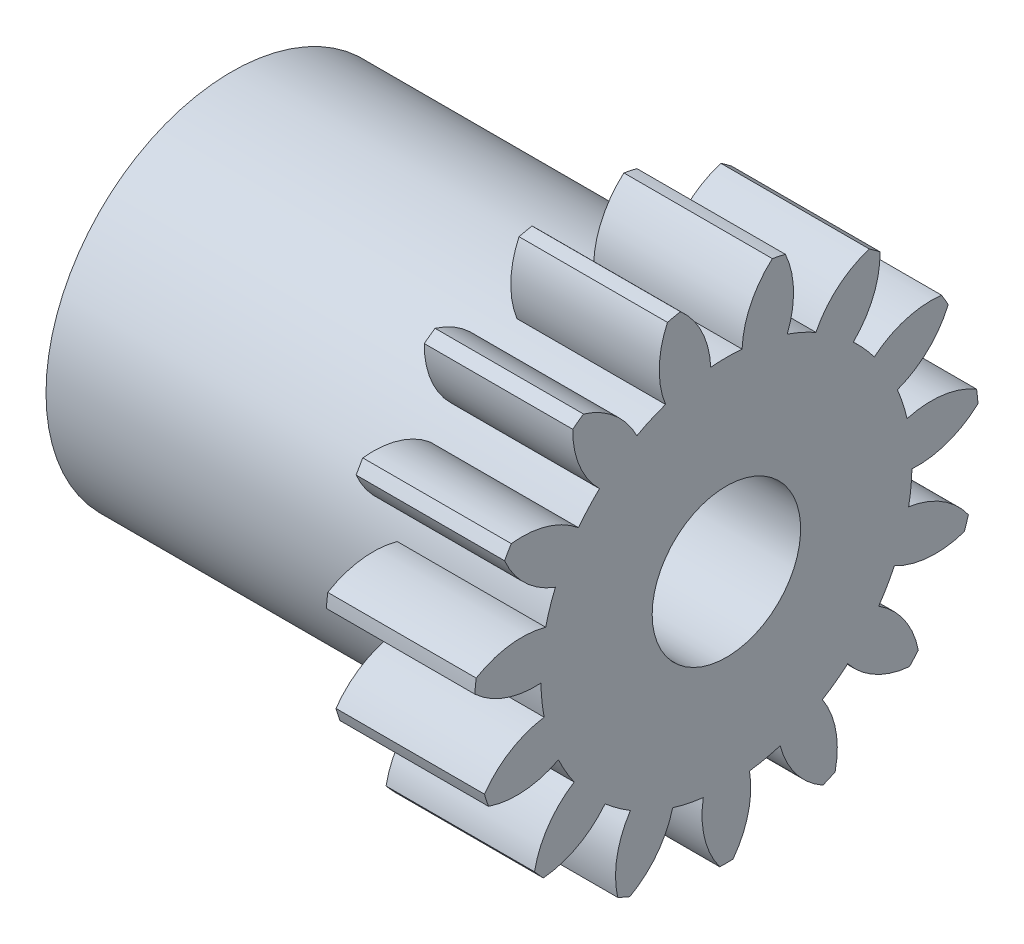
ISO-10303-21;
HEADER;
FILE_DESCRIPTION(('STEP AP214'),'2;1');
FILE_NAME('part.step','',(''),(''),'','','');
FILE_SCHEMA(('AUTOMOTIVE_DESIGN { 1 0 10303 214 1 1 1 1 }'));
ENDSEC;
DATA;
#1=APPLICATION_CONTEXT('core data for automotive mechanical design processes');
#2=APPLICATION_PROTOCOL_DEFINITION('international standard','automotive_design',2000,#1);
#3=PRODUCT_CONTEXT('',#1,'mechanical');
#4=PRODUCT('Part','Part','',(#3));
#5=PRODUCT_RELATED_PRODUCT_CATEGORY('part','',(#4));
#6=PRODUCT_DEFINITION_FORMATION('','',#4);
#7=PRODUCT_DEFINITION_CONTEXT('part definition',#1,'design');
#8=PRODUCT_DEFINITION('design','',#6,#7);
#9=PRODUCT_DEFINITION_SHAPE('','',#8);
#10=(LENGTH_UNIT() NAMED_UNIT(*) SI_UNIT(.MILLI.,.METRE.));
#11=(NAMED_UNIT(*) PLANE_ANGLE_UNIT() SI_UNIT($,.RADIAN.));
#12=(NAMED_UNIT(*) SI_UNIT($,.STERADIAN.) SOLID_ANGLE_UNIT());
#13=UNCERTAINTY_MEASURE_WITH_UNIT(LENGTH_MEASURE(1.E-05),#10,'distance_accuracy_value','');
#14=(GEOMETRIC_REPRESENTATION_CONTEXT(3) GLOBAL_UNCERTAINTY_ASSIGNED_CONTEXT((#13)) GLOBAL_UNIT_ASSIGNED_CONTEXT((#10,
#11,#12)) REPRESENTATION_CONTEXT('',''));
#15=CARTESIAN_POINT('',(0.,0.,0.));
#16=DIRECTION('',(0.,0.,1.));
#17=DIRECTION('',(1.,0.,0.));
#18=AXIS2_PLACEMENT_3D('',#15,#16,#17);
#19=CARTESIAN_POINT('',(0.,0.,0.));
#20=DIRECTION('',(1.,0.,0.));
#21=DIRECTION('',(0.,0.,-1.));
#22=AXIS2_PLACEMENT_3D('',#19,#20,#21);
#23=PLANE('',#22);
#24=CARTESIAN_POINT('',(0.,0.,0.));
#25=DIRECTION('',(-1.,0.,0.));
#26=DIRECTION('',(0.,0.,1.));
#27=AXIS2_PLACEMENT_3D('',#24,#25,#26);
#28=CIRCLE('',#27,18.749);
#29=CARTESIAN_POINT('',(0.,-3.52870603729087,-18.4139413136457));
#30=VERTEX_POINT('',#29);
#31=CARTESIAN_POINT('',(0.,-7.96865998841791,-16.9713128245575));
#32=VERTEX_POINT('',#31);
#33=EDGE_CURVE('E477',#30,#32,#28,.T.);
#34=ORIENTED_EDGE('',*,*,#33,.F.);
#35=CARTESIAN_POINT('',(0.,-12.4325038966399,-17.1015451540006));
#36=DIRECTION('',(-1.,0.,0.));
#37=DIRECTION('',(0.,-0.994521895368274,0.104528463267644));
#38=AXIS2_PLACEMENT_3D('',#35,#36,#37);
#39=CIRCLE('',#38,9.00000000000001);
#40=CARTESIAN_POINT('',(0.,-7.23802371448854,-24.4511965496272));
#41=VERTEX_POINT('',#40);
#42=EDGE_CURVE('E616',#30,#41,#39,.T.);
#43=ORIENTED_EDGE('',*,*,#42,.T.);
#44=CARTESIAN_POINT('',(0.,0.,0.));
#45=DIRECTION('',(-1.,0.,0.));
#46=DIRECTION('',(0.,0.,1.));
#47=AXIS2_PLACEMENT_3D('',#44,#45,#46);
#48=CIRCLE('',#47,25.5);
#49=CARTESIAN_POINT('',(0.,-8.51636854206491,-24.0358371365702));
#50=VERTEX_POINT('',#49);
#51=EDGE_CURVE('E795',#41,#50,#48,.T.);
#52=ORIENTED_EDGE('',*,*,#51,.T.);
#53=CARTESIAN_POINT('',(0.,0.00607090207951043,-21.1430830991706));
#54=DIRECTION('',(1.,0.,0.));
#55=DIRECTION('',(0.,0.,-1.));
#56=AXIS2_PLACEMENT_3D('',#53,#54,#55);
#57=CIRCLE('',#56,9.00000000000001);
#58=EDGE_CURVE('E752',#32,#50,#57,.T.);
#59=ORIENTED_EDGE('',*,*,#58,.F.);
#60=EDGE_LOOP('',(#34,#43,#52,#59));
#61=FACE_BOUND('',#60,.T.);
#62=ADVANCED_FACE('F35',(#61),#23,.F.);
#63=CARTESIAN_POINT('',(0.,-10.7132580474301,-15.3867183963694));
#64=VERTEX_POINT('',#63);
#65=CARTESIAN_POINT('',(0.,-14.1825879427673,-12.2629197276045));
#66=VERTEX_POINT('',#65);
#67=EDGE_CURVE('E481',#64,#66,#28,.T.);
#68=ORIENTED_EDGE('',*,*,#67,.F.);
#69=CARTESIAN_POINT('',(0.,-18.3134825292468,-10.5662839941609));
#70=DIRECTION('',(-1.,0.,0.));
#71=DIRECTION('',(0.,-0.866025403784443,0.499999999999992));
#72=AXIS2_PLACEMENT_3D('',#69,#70,#71);
#73=CIRCLE('',#72,9.00000000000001);
#74=CARTESIAN_POINT('',(0.,-16.5574612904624,-19.3933100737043));
#75=VERTEX_POINT('',#74);
#76=EDGE_CURVE('E549',#64,#75,#73,.T.);
#77=ORIENTED_EDGE('',*,*,#76,.T.);
#78=CARTESIAN_POINT('',(0.,-17.556345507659,-18.4939106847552));
#79=VERTEX_POINT('',#78);
#80=EDGE_CURVE('E800',#75,#79,#48,.T.);
#81=ORIENTED_EDGE('',*,*,#80,.T.);
#82=CARTESIAN_POINT('',(0.,-8.59412059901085,-19.3176367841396));
#83=DIRECTION('',(1.,0.,0.));
#84=DIRECTION('',(0.,0.,-1.));
#85=AXIS2_PLACEMENT_3D('',#82,#83,#84);
#86=CIRCLE('',#85,9.00000000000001);
#87=EDGE_CURVE('E754',#66,#79,#86,.T.);
#88=ORIENTED_EDGE('',*,*,#87,.F.);
#89=EDGE_LOOP('',(#68,#77,#81,#88));
#90=FACE_BOUND('',#89,.T.);
#91=ADVANCED_FACE('F982',(#90),#23,.F.);
#92=CARTESIAN_POINT('',(0.,-16.0453904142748,-9.6989920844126));
#93=VERTEX_POINT('',#92);
#94=CARTESIAN_POINT('',(0.,-17.9442175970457,-5.43415640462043));
#95=VERTEX_POINT('',#94);
#96=EDGE_CURVE('E485',#93,#95,#28,.T.);
#97=ORIENTED_EDGE('',*,*,#96,.F.);
#98=CARTESIAN_POINT('',(0.,-21.0278936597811,-2.20401634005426));
#99=DIRECTION('',(-1.,0.,0.));
#100=DIRECTION('',(0.,-0.58778525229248,0.809016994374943));
#101=AXIS2_PLACEMENT_3D('',#98,#99,#100);
#102=CIRCLE('',#101,9.00000000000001);
#103=CARTESIAN_POINT('',(0.,-23.0139633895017,-10.9821441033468));
#104=VERTEX_POINT('',#103);
#105=EDGE_CURVE('E560',#93,#104,#102,.T.);
#106=ORIENTED_EDGE('',*,*,#105,.T.);
#107=CARTESIAN_POINT('',(0.,-23.560670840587,-9.75421906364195));
#108=VERTEX_POINT('',#107);
#109=EDGE_CURVE('E805',#104,#108,#48,.T.);
#110=ORIENTED_EDGE('',*,*,#109,.T.);
#111=CARTESIAN_POINT('',(0.,-15.7083105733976,-14.1519955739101));
#112=DIRECTION('',(1.,0.,0.));
#113=DIRECTION('',(0.,0.,-1.));
#114=AXIS2_PLACEMENT_3D('',#111,#112,#113);
#115=CIRCLE('',#114,9.00000000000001);
#116=EDGE_CURVE('E750',#95,#108,#115,.T.);
#117=ORIENTED_EDGE('',*,*,#116,.F.);
#118=EDGE_LOOP('',(#97,#106,#110,#117));
#119=FACE_BOUND('',#118,.T.);
#120=ADVANCED_FACE('F988',(#119),#23,.F.);
#121=CARTESIAN_POINT('',(0.,-18.6031290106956,-2.33422192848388));
#122=VERTEX_POINT('',#121);
#123=CARTESIAN_POINT('',(0.,-18.6031290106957,2.33422192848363));
#124=VERTEX_POINT('',#123);
#125=EDGE_CURVE('E489',#122,#124,#28,.T.);
#126=ORIENTED_EDGE('',*,*,#125,.F.);
#127=CARTESIAN_POINT('',(0.,-20.1063909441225,6.53934576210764));
#128=DIRECTION('',(-1.,0.,0.));
#129=DIRECTION('',(0.,-0.207911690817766,0.978147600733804));
#130=AXIS2_PLACEMENT_3D('',#127,#128,#129);
#131=CIRCLE('',#130,9.00000000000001);
#132=CARTESIAN_POINT('',(0.,-25.4911421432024,-0.672065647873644));
#133=VERTEX_POINT('',#132);
#134=EDGE_CURVE('E573',#122,#133,#131,.T.);
#135=ORIENTED_EDGE('',*,*,#134,.T.);
#136=CARTESIAN_POINT('',(0.,-25.4911421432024,0.672065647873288));
#137=VERTEX_POINT('',#136);
#138=EDGE_CURVE('E810',#133,#137,#48,.T.);
#139=ORIENTED_EDGE('',*,*,#138,.T.);
#140=CARTESIAN_POINT('',(0.,-20.1063909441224,-6.53934576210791));
#141=DIRECTION('',(1.,0.,0.));
#142=DIRECTION('',(0.,0.,-1.));
#143=AXIS2_PLACEMENT_3D('',#140,#141,#142);
#144=CIRCLE('',#143,9.00000000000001);
#145=EDGE_CURVE('E757',#124,#137,#144,.T.);
#146=ORIENTED_EDGE('',*,*,#145,.F.);
#147=EDGE_LOOP('',(#126,#135,#139,#146));
#148=FACE_BOUND('',#147,.T.);
#149=ADVANCED_FACE('F960',(#148),#23,.F.);
#150=CARTESIAN_POINT('',(0.,-17.9442175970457,5.43415640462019));
#151=VERTEX_POINT('',#150);
#152=CARTESIAN_POINT('',(0.,-16.045390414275,9.69899208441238));
#153=VERTEX_POINT('',#152);
#154=EDGE_CURVE('E493',#151,#153,#28,.T.);
#155=ORIENTED_EDGE('',*,*,#154,.F.);
#156=CARTESIAN_POINT('',(0.,-15.7083105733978,14.1519955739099));
#157=DIRECTION('',(-1.,0.,0.));
#158=DIRECTION('',(0.,0.207911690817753,0.978147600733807));
#159=AXIS2_PLACEMENT_3D('',#156,#157,#158);
#160=CIRCLE('',#159,9.00000000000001);
#161=CARTESIAN_POINT('',(0.,-23.5606708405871,9.75421906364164));
#162=VERTEX_POINT('',#161);
#163=EDGE_CURVE('E586',#151,#162,#160,.T.);
#164=ORIENTED_EDGE('',*,*,#163,.T.);
#165=CARTESIAN_POINT('',(0.,-23.0139633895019,10.9821441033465));
#166=VERTEX_POINT('',#165);
#167=EDGE_CURVE('E815',#162,#166,#48,.T.);
#168=ORIENTED_EDGE('',*,*,#167,.T.);
#169=CARTESIAN_POINT('',(0.,-21.0278936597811,2.20401634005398));
#170=DIRECTION('',(1.,0.,0.));
#171=DIRECTION('',(0.,0.,-1.));
#172=AXIS2_PLACEMENT_3D('',#169,#170,#171);
#173=CIRCLE('',#172,9.00000000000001);
#174=EDGE_CURVE('E759',#153,#166,#173,.T.);
#175=ORIENTED_EDGE('',*,*,#174,.F.);
#176=EDGE_LOOP('',(#155,#164,#168,#175));
#177=FACE_BOUND('',#176,.T.);
#178=ADVANCED_FACE('F967',(#177),#23,.F.);
#179=CARTESIAN_POINT('',(0.,-14.1825879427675,12.2629197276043));
#180=VERTEX_POINT('',#179);
#181=CARTESIAN_POINT('',(0.,-10.7132580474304,15.3867183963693));
#182=VERTEX_POINT('',#181);
#183=EDGE_CURVE('E448',#180,#182,#28,.T.);
#184=ORIENTED_EDGE('',*,*,#183,.F.);
#185=CARTESIAN_POINT('',(0.,-8.59412059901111,19.3176367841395));
#186=DIRECTION('',(-1.,0.,0.));
#187=DIRECTION('',(0.,0.587785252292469,0.80901699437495));
#188=AXIS2_PLACEMENT_3D('',#185,#186,#187);
#189=CIRCLE('',#188,9.00000000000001);
#190=CARTESIAN_POINT('',(0.,-17.5563455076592,18.493910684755));
#191=VERTEX_POINT('',#190);
#192=EDGE_CURVE('E511',#180,#191,#189,.T.);
#193=ORIENTED_EDGE('',*,*,#192,.T.);
#194=CARTESIAN_POINT('',(0.,-16.5574612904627,19.393310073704));
#195=VERTEX_POINT('',#194);
#196=EDGE_CURVE('E777',#191,#195,#48,.T.);
#197=ORIENTED_EDGE('',*,*,#196,.T.);
#198=CARTESIAN_POINT('',(0.,-18.3134825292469,10.5662839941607));
#199=DIRECTION('',(1.,0.,0.));
#200=DIRECTION('',(0.,0.,-1.));
#201=AXIS2_PLACEMENT_3D('',#198,#199,#200);
#202=CIRCLE('',#201,9.00000000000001);
#203=EDGE_CURVE('E513',#182,#195,#202,.T.);
#204=ORIENTED_EDGE('',*,*,#203,.F.);
#205=EDGE_LOOP('',(#184,#193,#197,#204));
#206=FACE_BOUND('',#205,.T.);
#207=ADVANCED_FACE('F509',(#206),#23,.F.);
#208=CARTESIAN_POINT('',(0.,-7.96865998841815,16.9713128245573));
#209=VERTEX_POINT('',#208);
#210=CARTESIAN_POINT('',(0.,-3.52870603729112,18.4139413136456));
#211=VERTEX_POINT('',#210);
#212=EDGE_CURVE('E444',#209,#211,#28,.T.);
#213=ORIENTED_EDGE('',*,*,#212,.F.);
#214=CARTESIAN_POINT('',(0.,0.00607090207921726,21.1430830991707));
#215=DIRECTION('',(-1.,0.,0.));
#216=DIRECTION('',(0.,0.866025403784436,0.500000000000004));
#217=AXIS2_PLACEMENT_3D('',#214,#215,#216);
#218=CIRCLE('',#217,9.00000000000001);
#219=CARTESIAN_POINT('',(0.,-8.51636854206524,24.0358371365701));
#220=VERTEX_POINT('',#219);
#221=EDGE_CURVE('E533',#209,#220,#218,.T.);
#222=ORIENTED_EDGE('',*,*,#221,.T.);
#223=CARTESIAN_POINT('',(0.,-7.23802371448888,24.4511965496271));
#224=VERTEX_POINT('',#223);
#225=EDGE_CURVE('E774',#220,#224,#48,.T.);
#226=ORIENTED_EDGE('',*,*,#225,.T.);
#227=CARTESIAN_POINT('',(0.,-12.4325038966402,17.1015451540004));
#228=DIRECTION('',(1.,0.,0.));
#229=DIRECTION('',(0.,0.,-1.));
#230=AXIS2_PLACEMENT_3D('',#227,#228,#229);
#231=CIRCLE('',#230,9.00000000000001);
#232=EDGE_CURVE('E11',#211,#224,#231,.T.);
#233=ORIENTED_EDGE('',*,*,#232,.F.);
#234=EDGE_LOOP('',(#213,#222,#226,#233));
#235=FACE_BOUND('',#234,.T.);
#236=ADVANCED_FACE('F843',(#235),#23,.F.);
#237=CARTESIAN_POINT('',(0.,-0.376878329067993,18.7452117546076));
#238=VERTEX_POINT('',#237);
#239=CARTESIAN_POINT('',(0.,4.26599130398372,18.2572264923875));
#240=VERTEX_POINT('',#239);
#241=EDGE_CURVE('E423',#238,#240,#28,.T.);
#242=ORIENTED_EDGE('',*,*,#241,.F.);
#243=CARTESIAN_POINT('',(0.,8.60521268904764,19.3126982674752));
#244=DIRECTION('',(-1.,0.,0.));
#245=DIRECTION('',(0.,0.994521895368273,0.104528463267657));
#246=AXIS2_PLACEMENT_3D('',#243,#244,#245);
#247=CIRCLE('',#246,9.00000000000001);
#248=CARTESIAN_POINT('',(0.,1.99616591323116,25.4217489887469));
#249=VERTEX_POINT('',#248);
#250=EDGE_CURVE('E432',#238,#249,#247,.T.);
#251=ORIENTED_EDGE('',*,*,#250,.T.);
#252=CARTESIAN_POINT('',(0.,3.33293391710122,25.2812490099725));
#253=VERTEX_POINT('',#252);
#254=EDGE_CURVE('E771',#249,#253,#48,.T.);
#255=ORIENTED_EDGE('',*,*,#254,.T.);
#256=CARTESIAN_POINT('',(0.,-4.40183239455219,20.6797937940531));
#257=DIRECTION('',(1.,0.,0.));
#258=DIRECTION('',(0.,0.,-1.));
#259=AXIS2_PLACEMENT_3D('',#256,#257,#258);
#260=CIRCLE('',#259,9.00000000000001);
#261=EDGE_CURVE('E44',#240,#253,#260,.T.);
#262=ORIENTED_EDGE('',*,*,#261,.F.);
#263=EDGE_LOOP('',(#242,#251,#255,#262));
#264=FACE_BOUND('',#263,.T.);
#265=ADVANCED_FACE('F443',(#264),#23,.F.);
#266=CARTESIAN_POINT('',(0.,7.28006901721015,17.2778932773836));
#267=VERTEX_POINT('',#266);
#268=CARTESIAN_POINT('',(0.,11.3230599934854,14.9436713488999));
#269=VERTEX_POINT('',#268);
#270=EDGE_CURVE('E51',#267,#269,#28,.T.);
#271=ORIENTED_EDGE('',*,*,#270,.F.);
#272=CARTESIAN_POINT('',(0.,15.7164350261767,14.1429724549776));
#273=DIRECTION('',(-1.,0.,0.));
#274=DIRECTION('',(0.,0.951056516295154,-0.309016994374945));
#275=AXIS2_PLACEMENT_3D('',#272,#273,#274);
#276=CIRCLE('',#275,9.00000000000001);
#277=CARTESIAN_POINT('',(0.,12.1635451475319,22.4120094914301));
#278=VERTEX_POINT('',#277);
#279=EDGE_CURVE('E860',#267,#278,#276,.T.);
#280=ORIENTED_EDGE('',*,*,#279,.T.);
#281=CARTESIAN_POINT('',(0.,13.3275969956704,21.7399438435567));
#282=VERTEX_POINT('',#281);
#283=EDGE_CURVE('E775',#278,#282,#48,.T.);
#284=ORIENTED_EDGE('',*,*,#283,.T.);
#285=CARTESIAN_POINT('',(0.,4.38995591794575,20.6823182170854));
#286=DIRECTION('',(1.,0.,0.));
#287=DIRECTION('',(0.,0.,-1.));
#288=AXIS2_PLACEMENT_3D('',#285,#286,#287);
#289=CIRCLE('',#288,9.00000000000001);
#290=EDGE_CURVE('E761',#269,#282,#289,.T.);
#291=ORIENTED_EDGE('',*,*,#290,.F.);
#292=EDGE_LOOP('',(#271,#280,#284,#291));
#293=FACE_BOUND('',#292,.T.);
#294=ADVANCED_FACE('F1068',(#293),#23,.F.);
#295=CARTESIAN_POINT('',(0.,13.6782262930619,12.8230700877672));
#296=VERTEX_POINT('',#295);
#297=CARTESIAN_POINT('',(0.,16.4222687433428,9.04621967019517));
#298=VERTEX_POINT('',#297);
#299=EDGE_CURVE('E59',#296,#298,#28,.T.);
#300=ORIENTED_EDGE('',*,*,#299,.F.);
#301=CARTESIAN_POINT('',(0.,20.1101429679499,6.52779822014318));
#302=DIRECTION('',(-1.,0.,0.));
#303=DIRECTION('',(0.,0.743144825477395,-0.669130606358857));
#304=AXIS2_PLACEMENT_3D('',#301,#302,#303);
#305=CIRCLE('',#304,9.00000000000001);
#306=CARTESIAN_POINT('',(0.,20.2277369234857,15.5270299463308));
#307=VERTEX_POINT('',#306);
#308=EDGE_CURVE('E864',#296,#307,#305,.T.);
#309=ORIENTED_EDGE('',*,*,#308,.T.);
#310=CARTESIAN_POINT('',(0.,21.0177974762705,14.4396048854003));
#311=VERTEX_POINT('',#310);
#312=EDGE_CURVE('E730',#307,#311,#48,.T.);
#313=ORIENTED_EDGE('',*,*,#312,.T.);
#314=CARTESIAN_POINT('',(0.,12.4226809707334,17.1086819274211));
#315=DIRECTION('',(1.,0.,0.));
#316=DIRECTION('',(0.,0.,-1.));
#317=AXIS2_PLACEMENT_3D('',#314,#315,#316);
#318=CIRCLE('',#317,9.00000000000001);
#319=EDGE_CURVE('E739',#298,#311,#318,.T.);
#320=ORIENTED_EDGE('',*,*,#319,.F.);
#321=EDGE_LOOP('',(#300,#309,#313,#320));
#322=FACE_BOUND('',#321,.T.);
#323=ADVANCED_FACE('F1072',(#322),#23,.F.);
#324=CARTESIAN_POINT('',(0.,17.7112939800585,6.15102158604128));
#325=VERTEX_POINT('',#324);
#326=CARTESIAN_POINT('',(0.,18.6819180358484,1.58459442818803));
#327=VERTEX_POINT('',#326);
#328=EDGE_CURVE('E458',#325,#327,#28,.T.);
#329=ORIENTED_EDGE('',*,*,#328,.F.);
#330=CARTESIAN_POINT('',(0.,21.0266244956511,-2.2160916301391));
#331=DIRECTION('',(-1.,0.,0.));
#332=DIRECTION('',(0.,0.406736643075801,-0.913545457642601));
#333=AXIS2_PLACEMENT_3D('',#330,#331,#332);
#334=CIRCLE('',#333,9.00000000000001);
#335=CARTESIAN_POINT('',(0.,24.7943692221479,5.95728586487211));
#336=VERTEX_POINT('',#335);
#337=EDGE_CURVE('E688',#325,#336,#334,.T.);
#338=ORIENTED_EDGE('',*,*,#337,.T.);
#339=CARTESIAN_POINT('',(0.,25.0738298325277,4.64252706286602));
#340=VERTEX_POINT('',#339);
#341=EDGE_CURVE('E724',#336,#340,#48,.T.);
#342=ORIENTED_EDGE('',*,*,#341,.T.);
#343=CARTESIAN_POINT('',(0.,18.3074116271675,10.5767991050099));
#344=DIRECTION('',(1.,0.,0.));
#345=DIRECTION('',(0.,0.,-1.));
#346=AXIS2_PLACEMENT_3D('',#343,#344,#345);
#347=CIRCLE('',#346,9.00000000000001);
#348=EDGE_CURVE('E734',#327,#340,#347,.T.);
#349=ORIENTED_EDGE('',*,*,#348,.F.);
#350=EDGE_LOOP('',(#329,#338,#342,#349));
#351=FACE_BOUND('',#350,.T.);
#352=ADVANCED_FACE('F1076',(#351),#23,.F.);
#353=CARTESIAN_POINT('',(0.,18.6819180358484,-1.58459442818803));
#354=VERTEX_POINT('',#353);
#355=CARTESIAN_POINT('',(0.,17.7112939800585,-6.15102158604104));
#356=VERTEX_POINT('',#355);
#357=EDGE_CURVE('E462',#354,#356,#28,.T.);
#358=ORIENTED_EDGE('',*,*,#357,.F.);
#359=CARTESIAN_POINT('',(0.,18.3074116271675,-10.5767991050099));
#360=DIRECTION('',(-1.,0.,0.));
#361=DIRECTION('',(0.,0.,-1.));
#362=AXIS2_PLACEMENT_3D('',#359,#360,#361);
#363=CIRCLE('',#362,9.00000000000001);
#364=CARTESIAN_POINT('',(0.,25.0738298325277,-4.64252706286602));
#365=VERTEX_POINT('',#364);
#366=EDGE_CURVE('E706',#354,#365,#363,.T.);
#367=ORIENTED_EDGE('',*,*,#366,.T.);
#368=CARTESIAN_POINT('',(0.,24.794369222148,-5.95728586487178));
#369=VERTEX_POINT('',#368);
#370=EDGE_CURVE('E725',#365,#369,#48,.T.);
#371=ORIENTED_EDGE('',*,*,#370,.T.);
#372=CARTESIAN_POINT('',(0.,21.0266244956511,2.21609163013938));
#373=DIRECTION('',(1.,0.,0.));
#374=DIRECTION('',(0.,0.,-1.));
#375=AXIS2_PLACEMENT_3D('',#372,#373,#374);
#376=CIRCLE('',#375,9.00000000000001);
#377=EDGE_CURVE('E746',#356,#369,#376,.T.);
#378=ORIENTED_EDGE('',*,*,#377,.F.);
#379=EDGE_LOOP('',(#358,#367,#371,#378));
#380=FACE_BOUND('',#379,.T.);
#381=ADVANCED_FACE('F1007',(#380),#23,.F.);
#382=CARTESIAN_POINT('',(0.,16.4222687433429,-9.04621967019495));
#383=VERTEX_POINT('',#382);
#384=CARTESIAN_POINT('',(0.,13.6782262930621,-12.823070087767));
#385=VERTEX_POINT('',#384);
#386=EDGE_CURVE('E466',#383,#385,#28,.T.);
#387=ORIENTED_EDGE('',*,*,#386,.F.);
#388=CARTESIAN_POINT('',(0.,12.4226809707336,-17.108681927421));
#389=DIRECTION('',(-1.,0.,0.));
#390=DIRECTION('',(0.,-0.406736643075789,-0.913545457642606));
#391=AXIS2_PLACEMENT_3D('',#388,#389,#390);
#392=CIRCLE('',#391,9.00000000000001);
#393=CARTESIAN_POINT('',(0.,21.0177974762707,-14.4396048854));
#394=VERTEX_POINT('',#393);
#395=EDGE_CURVE('E457',#383,#394,#392,.T.);
#396=ORIENTED_EDGE('',*,*,#395,.T.);
#397=CARTESIAN_POINT('',(0.,20.2277369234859,-15.5270299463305));
#398=VERTEX_POINT('',#397);
#399=EDGE_CURVE('E729',#394,#398,#48,.T.);
#400=ORIENTED_EDGE('',*,*,#399,.T.);
#401=CARTESIAN_POINT('',(0.,20.11014296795,-6.5277982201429));
#402=DIRECTION('',(1.,0.,0.));
#403=DIRECTION('',(0.,0.,-1.));
#404=AXIS2_PLACEMENT_3D('',#401,#402,#403);
#405=CIRCLE('',#404,9.00000000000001);
#406=EDGE_CURVE('E748',#385,#398,#405,.T.);
#407=ORIENTED_EDGE('',*,*,#406,.F.);
#408=EDGE_LOOP('',(#387,#396,#400,#407));
#409=FACE_BOUND('',#408,.T.);
#410=ADVANCED_FACE('F1001',(#409),#23,.F.);
#411=CARTESIAN_POINT('',(0.,11.3230599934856,-14.9436713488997));
#412=VERTEX_POINT('',#411);
#413=CARTESIAN_POINT('',(0.,7.28006901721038,-17.2778932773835));
#414=VERTEX_POINT('',#413);
#415=EDGE_CURVE('E469',#412,#414,#28,.T.);
#416=ORIENTED_EDGE('',*,*,#415,.F.);
#417=CARTESIAN_POINT('',(0.,4.38995591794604,-20.6823182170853));
#418=DIRECTION('',(-1.,0.,0.));
#419=DIRECTION('',(0.,-0.743144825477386,-0.669130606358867));
#420=AXIS2_PLACEMENT_3D('',#417,#418,#419);
#421=CIRCLE('',#420,9.00000000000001);
#422=CARTESIAN_POINT('',(0.,13.3275969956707,-21.7399438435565));
#423=VERTEX_POINT('',#422);
#424=EDGE_CURVE('E599',#412,#423,#421,.T.);
#425=ORIENTED_EDGE('',*,*,#424,.T.);
#426=CARTESIAN_POINT('',(0.,12.1635451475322,-22.41200949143));
#427=VERTEX_POINT('',#426);
#428=EDGE_CURVE('E785',#423,#427,#48,.T.);
#429=ORIENTED_EDGE('',*,*,#428,.T.);
#430=CARTESIAN_POINT('',(0.,15.7164350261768,-14.1429724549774));
#431=DIRECTION('',(1.,0.,0.));
#432=DIRECTION('',(0.,0.,-1.));
#433=AXIS2_PLACEMENT_3D('',#430,#431,#432);
#434=CIRCLE('',#433,9.00000000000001);
#435=EDGE_CURVE('E744',#414,#427,#434,.T.);
#436=ORIENTED_EDGE('',*,*,#435,.F.);
#437=EDGE_LOOP('',(#416,#425,#429,#436));
#438=FACE_BOUND('',#437,.T.);
#439=ADVANCED_FACE('F993',(#438),#23,.F.);
#440=CARTESIAN_POINT('',(15.,0.,0.));
#441=DIRECTION('',(-1.,0.,0.));
#442=DIRECTION('',(0.,0.,1.));
#443=AXIS2_PLACEMENT_3D('',#440,#441,#442);
#444=PLANE('',#443);
#445=CARTESIAN_POINT('',(15.,0.,0.));
#446=DIRECTION('',(-1.,0.,0.));
#447=DIRECTION('',(0.,0.,1.));
#448=AXIS2_PLACEMENT_3D('',#445,#446,#447);
#449=CIRCLE('',#448,7.5);
#450=CARTESIAN_POINT('',(15.,0.,7.5));
#451=VERTEX_POINT('',#450);
#452=EDGE_CURVE('E445',#451,#451,#449,.F.);
#453=ORIENTED_EDGE('',*,*,#452,.F.);
#454=EDGE_LOOP('',(#453));
#455=FACE_BOUND('',#454,.T.);
#456=CARTESIAN_POINT('',(15.,8.60521268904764,19.3126982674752));
#457=DIRECTION('',(-1.,0.,0.));
#458=DIRECTION('',(0.,0.994521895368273,0.104528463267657));
#459=AXIS2_PLACEMENT_3D('',#456,#457,#458);
#460=CIRCLE('',#459,9.00000000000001);
#461=CARTESIAN_POINT('',(15.,-0.376878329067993,18.7452117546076));
#462=VERTEX_POINT('',#461);
#463=CARTESIAN_POINT('',(15.,1.99616591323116,25.4217489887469));
#464=VERTEX_POINT('',#463);
#465=EDGE_CURVE('E439',#462,#464,#460,.T.);
#466=ORIENTED_EDGE('',*,*,#465,.F.);
#467=CARTESIAN_POINT('',(15.,0.,0.));
#468=DIRECTION('',(-1.,0.,0.));
#469=DIRECTION('',(0.,0.994521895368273,0.104528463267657));
#470=AXIS2_PLACEMENT_3D('',#467,#468,#469);
#471=CIRCLE('',#470,18.749);
#472=CARTESIAN_POINT('',(15.,-3.52870603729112,18.4139413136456));
#473=VERTEX_POINT('',#472);
#474=EDGE_CURVE('E426',#473,#462,#471,.T.);
#475=ORIENTED_EDGE('',*,*,#474,.F.);
#476=CARTESIAN_POINT('',(15.,-12.4325038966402,17.1015451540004));
#477=DIRECTION('',(-1.,0.,0.));
#478=DIRECTION('',(0.,0.994521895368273,0.104528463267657));
#479=AXIS2_PLACEMENT_3D('',#476,#477,#478);
#480=CIRCLE('',#479,9.00000000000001);
#481=CARTESIAN_POINT('',(15.,-7.23802371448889,24.4511965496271));
#482=VERTEX_POINT('',#481);
#483=EDGE_CURVE('E853',#482,#473,#480,.T.);
#484=ORIENTED_EDGE('',*,*,#483,.F.);
#485=CARTESIAN_POINT('',(15.,0.,0.));
#486=DIRECTION('',(-1.,0.,0.));
#487=DIRECTION('',(0.,0.,1.));
#488=AXIS2_PLACEMENT_3D('',#485,#486,#487);
#489=CIRCLE('',#488,25.5);
#490=CARTESIAN_POINT('',(15.,-8.51636854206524,24.0358371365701));
#491=VERTEX_POINT('',#490);
#492=EDGE_CURVE('E849',#491,#482,#489,.T.);
#493=ORIENTED_EDGE('',*,*,#492,.F.);
#494=CARTESIAN_POINT('',(15.,0.00607090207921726,21.1430830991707));
#495=DIRECTION('',(-1.,0.,0.));
#496=DIRECTION('',(0.,0.866025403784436,0.500000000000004));
#497=AXIS2_PLACEMENT_3D('',#494,#495,#496);
#498=CIRCLE('',#497,9.00000000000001);
#499=CARTESIAN_POINT('',(15.,-7.96865998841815,16.9713128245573));
#500=VERTEX_POINT('',#499);
#501=EDGE_CURVE('E534',#500,#491,#498,.T.);
#502=ORIENTED_EDGE('',*,*,#501,.F.);
#503=CARTESIAN_POINT('',(15.,0.,0.));
#504=DIRECTION('',(-1.,0.,0.));
#505=DIRECTION('',(0.,0.866025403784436,0.500000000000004));
#506=AXIS2_PLACEMENT_3D('',#503,#504,#505);
#507=CIRCLE('',#506,18.749);
#508=CARTESIAN_POINT('',(15.,-10.7132580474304,15.3867183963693));
#509=VERTEX_POINT('',#508);
#510=EDGE_CURVE('E538',#509,#500,#507,.T.);
#511=ORIENTED_EDGE('',*,*,#510,.F.);
#512=CARTESIAN_POINT('',(15.,-18.3134825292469,10.5662839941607));
#513=DIRECTION('',(-1.,0.,0.));
#514=DIRECTION('',(0.,0.866025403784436,0.500000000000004));
#515=AXIS2_PLACEMENT_3D('',#512,#513,#514);
#516=CIRCLE('',#515,9.00000000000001);
#517=CARTESIAN_POINT('',(15.,-16.5574612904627,19.393310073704));
#518=VERTEX_POINT('',#517);
#519=EDGE_CURVE('E536',#518,#509,#516,.T.);
#520=ORIENTED_EDGE('',*,*,#519,.F.);
#521=CARTESIAN_POINT('',(15.,-17.5563455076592,18.493910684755));
#522=VERTEX_POINT('',#521);
#523=EDGE_CURVE('E829',#522,#518,#489,.T.);
#524=ORIENTED_EDGE('',*,*,#523,.F.);
#525=CARTESIAN_POINT('',(15.,-8.59412059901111,19.3176367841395));
#526=DIRECTION('',(-1.,0.,0.));
#527=DIRECTION('',(0.,0.587785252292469,0.80901699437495));
#528=AXIS2_PLACEMENT_3D('',#525,#526,#527);
#529=CIRCLE('',#528,9.00000000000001);
#530=CARTESIAN_POINT('',(15.,-14.1825879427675,12.2629197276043));
#531=VERTEX_POINT('',#530);
#532=EDGE_CURVE('E519',#531,#522,#529,.T.);
#533=ORIENTED_EDGE('',*,*,#532,.F.);
#534=CARTESIAN_POINT('',(15.,0.,0.));
#535=DIRECTION('',(-1.,0.,0.));
#536=DIRECTION('',(0.,0.587785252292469,0.80901699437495));
#537=AXIS2_PLACEMENT_3D('',#534,#535,#536);
#538=CIRCLE('',#537,18.749);
#539=CARTESIAN_POINT('',(15.,-16.045390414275,9.69899208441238));
#540=VERTEX_POINT('',#539);
#541=EDGE_CURVE('E528',#540,#531,#538,.T.);
#542=ORIENTED_EDGE('',*,*,#541,.F.);
#543=CARTESIAN_POINT('',(15.,-21.0278936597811,2.20401634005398));
#544=DIRECTION('',(-1.,0.,0.));
#545=DIRECTION('',(0.,0.587785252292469,0.80901699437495));
#546=AXIS2_PLACEMENT_3D('',#543,#544,#545);
#547=CIRCLE('',#546,9.00000000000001);
#548=CARTESIAN_POINT('',(15.,-23.0139633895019,10.9821441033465));
#549=VERTEX_POINT('',#548);
#550=EDGE_CURVE('E522',#549,#540,#547,.T.);
#551=ORIENTED_EDGE('',*,*,#550,.F.);
#552=CARTESIAN_POINT('',(15.,-23.5606708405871,9.75421906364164));
#553=VERTEX_POINT('',#552);
#554=EDGE_CURVE('E885',#553,#549,#489,.T.);
#555=ORIENTED_EDGE('',*,*,#554,.F.);
#556=CARTESIAN_POINT('',(15.,-15.7083105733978,14.1519955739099));
#557=DIRECTION('',(-1.,0.,0.));
#558=DIRECTION('',(0.,0.207911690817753,0.978147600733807));
#559=AXIS2_PLACEMENT_3D('',#556,#557,#558);
#560=CIRCLE('',#559,9.00000000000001);
#561=CARTESIAN_POINT('',(15.,-17.9442175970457,5.43415640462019));
#562=VERTEX_POINT('',#561);
#563=EDGE_CURVE('E872',#562,#553,#560,.T.);
#564=ORIENTED_EDGE('',*,*,#563,.F.);
#565=CARTESIAN_POINT('',(15.,0.,0.));
#566=DIRECTION('',(-1.,0.,0.));
#567=DIRECTION('',(0.,0.207911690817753,0.978147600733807));
#568=AXIS2_PLACEMENT_3D('',#565,#566,#567);
#569=CIRCLE('',#568,18.749);
#570=CARTESIAN_POINT('',(15.,-18.6031290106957,2.33422192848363));
#571=VERTEX_POINT('',#570);
#572=EDGE_CURVE('E876',#571,#562,#569,.T.);
#573=ORIENTED_EDGE('',*,*,#572,.F.);
#574=CARTESIAN_POINT('',(15.,-20.1063909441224,-6.53934576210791));
#575=DIRECTION('',(-1.,0.,0.));
#576=DIRECTION('',(0.,0.207911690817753,0.978147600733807));
#577=AXIS2_PLACEMENT_3D('',#574,#575,#576);
#578=CIRCLE('',#577,9.00000000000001);
#579=CARTESIAN_POINT('',(15.,-25.4911421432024,0.672065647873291));
#580=VERTEX_POINT('',#579);
#581=EDGE_CURVE('E874',#580,#571,#578,.T.);
#582=ORIENTED_EDGE('',*,*,#581,.F.);
#583=CARTESIAN_POINT('',(15.,-25.4911421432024,-0.672065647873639));
#584=VERTEX_POINT('',#583);
#585=EDGE_CURVE('E890',#584,#580,#489,.T.);
#586=ORIENTED_EDGE('',*,*,#585,.F.);
#587=CARTESIAN_POINT('',(15.,-20.1063909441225,6.53934576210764));
#588=DIRECTION('',(-1.,0.,0.));
#589=DIRECTION('',(0.,-0.207911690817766,0.978147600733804));
#590=AXIS2_PLACEMENT_3D('',#587,#588,#589);
#591=CIRCLE('',#590,9.00000000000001);
#592=CARTESIAN_POINT('',(15.,-18.6031290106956,-2.33422192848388));
#593=VERTEX_POINT('',#592);
#594=EDGE_CURVE('E574',#593,#584,#591,.T.);
#595=ORIENTED_EDGE('',*,*,#594,.F.);
#596=CARTESIAN_POINT('',(15.,0.,0.));
#597=DIRECTION('',(-1.,0.,0.));
#598=DIRECTION('',(0.,-0.207911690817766,0.978147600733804));
#599=AXIS2_PLACEMENT_3D('',#596,#597,#598);
#600=CIRCLE('',#599,18.749);
#601=CARTESIAN_POINT('',(15.,-17.9442175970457,-5.43415640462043));
#602=VERTEX_POINT('',#601);
#603=EDGE_CURVE('E578',#602,#593,#600,.T.);
#604=ORIENTED_EDGE('',*,*,#603,.F.);
#605=CARTESIAN_POINT('',(15.,-15.7083105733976,-14.1519955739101));
#606=DIRECTION('',(-1.,0.,0.));
#607=DIRECTION('',(0.,-0.207911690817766,0.978147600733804));
#608=AXIS2_PLACEMENT_3D('',#605,#606,#607);
#609=CIRCLE('',#608,9.00000000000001);
#610=CARTESIAN_POINT('',(15.,-23.560670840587,-9.75421906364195));
#611=VERTEX_POINT('',#610);
#612=EDGE_CURVE('E576',#611,#602,#609,.T.);
#613=ORIENTED_EDGE('',*,*,#612,.F.);
#614=CARTESIAN_POINT('',(15.,-23.0139633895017,-10.9821441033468));
#615=VERTEX_POINT('',#614);
#616=EDGE_CURVE('E892',#615,#611,#489,.T.);
#617=ORIENTED_EDGE('',*,*,#616,.F.);
#618=CARTESIAN_POINT('',(15.,-21.0278936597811,-2.20401634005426));
#619=DIRECTION('',(-1.,0.,0.));
#620=DIRECTION('',(0.,-0.58778525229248,0.809016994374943));
#621=AXIS2_PLACEMENT_3D('',#618,#619,#620);
#622=CIRCLE('',#621,9.00000000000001);
#623=CARTESIAN_POINT('',(15.,-16.0453904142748,-9.6989920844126));
#624=VERTEX_POINT('',#623);
#625=EDGE_CURVE('E561',#624,#615,#622,.T.);
#626=ORIENTED_EDGE('',*,*,#625,.F.);
#627=CARTESIAN_POINT('',(15.,0.,0.));
#628=DIRECTION('',(-1.,0.,0.));
#629=DIRECTION('',(0.,-0.58778525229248,0.809016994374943));
#630=AXIS2_PLACEMENT_3D('',#627,#628,#629);
#631=CIRCLE('',#630,18.749);
#632=CARTESIAN_POINT('',(15.,-14.1825879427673,-12.2629197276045));
#633=VERTEX_POINT('',#632);
#634=EDGE_CURVE('E565',#633,#624,#631,.T.);
#635=ORIENTED_EDGE('',*,*,#634,.F.);
#636=CARTESIAN_POINT('',(15.,-8.59412059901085,-19.3176367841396));
#637=DIRECTION('',(-1.,0.,0.));
#638=DIRECTION('',(0.,-0.58778525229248,0.809016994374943));
#639=AXIS2_PLACEMENT_3D('',#636,#637,#638);
#640=CIRCLE('',#639,9.00000000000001);
#641=CARTESIAN_POINT('',(15.,-17.556345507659,-18.4939106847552));
#642=VERTEX_POINT('',#641);
#643=EDGE_CURVE('E563',#642,#633,#640,.T.);
#644=ORIENTED_EDGE('',*,*,#643,.F.);
#645=CARTESIAN_POINT('',(15.,-16.5574612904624,-19.3933100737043));
#646=VERTEX_POINT('',#645);
#647=EDGE_CURVE('E926',#646,#642,#489,.T.);
#648=ORIENTED_EDGE('',*,*,#647,.F.);
#649=CARTESIAN_POINT('',(15.,-18.3134825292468,-10.5662839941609));
#650=DIRECTION('',(-1.,0.,0.));
#651=DIRECTION('',(0.,-0.866025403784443,0.499999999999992));
#652=AXIS2_PLACEMENT_3D('',#649,#650,#651);
#653=CIRCLE('',#652,9.00000000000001);
#654=CARTESIAN_POINT('',(15.,-10.7132580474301,-15.3867183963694));
#655=VERTEX_POINT('',#654);
#656=EDGE_CURVE('E546',#655,#646,#653,.T.);
#657=ORIENTED_EDGE('',*,*,#656,.F.);
#658=CARTESIAN_POINT('',(15.,0.,0.));
#659=DIRECTION('',(-1.,0.,0.));
#660=DIRECTION('',(0.,-0.866025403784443,0.499999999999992));
#661=AXIS2_PLACEMENT_3D('',#658,#659,#660);
#662=CIRCLE('',#661,18.749);
#663=CARTESIAN_POINT('',(15.,-7.96865998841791,-16.9713128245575));
#664=VERTEX_POINT('',#663);
#665=EDGE_CURVE('E551',#664,#655,#662,.T.);
#666=ORIENTED_EDGE('',*,*,#665,.F.);
#667=CARTESIAN_POINT('',(15.,0.00607090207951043,-21.1430830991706));
#668=DIRECTION('',(-1.,0.,0.));
#669=DIRECTION('',(0.,-0.866025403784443,0.499999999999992));
#670=AXIS2_PLACEMENT_3D('',#667,#668,#669);
#671=CIRCLE('',#670,9.00000000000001);
#672=CARTESIAN_POINT('',(15.,-8.51636854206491,-24.0358371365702));
#673=VERTEX_POINT('',#672);
#674=EDGE_CURVE('E548',#673,#664,#671,.T.);
#675=ORIENTED_EDGE('',*,*,#674,.F.);
#676=CARTESIAN_POINT('',(15.,-7.23802371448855,-24.4511965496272));
#677=VERTEX_POINT('',#676);
#678=EDGE_CURVE('E920',#677,#673,#489,.T.);
#679=ORIENTED_EDGE('',*,*,#678,.F.);
#680=CARTESIAN_POINT('',(15.,-12.4325038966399,-17.1015451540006));
#681=DIRECTION('',(-1.,0.,0.));
#682=DIRECTION('',(0.,-0.994521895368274,0.104528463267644));
#683=AXIS2_PLACEMENT_3D('',#680,#681,#682);
#684=CIRCLE('',#683,9.00000000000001);
#685=CARTESIAN_POINT('',(15.,-3.52870603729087,-18.4139413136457));
#686=VERTEX_POINT('',#685);
#687=EDGE_CURVE('E613',#686,#677,#684,.T.);
#688=ORIENTED_EDGE('',*,*,#687,.F.);
#689=CARTESIAN_POINT('',(15.,0.,0.));
#690=DIRECTION('',(-1.,0.,0.));
#691=DIRECTION('',(0.,-0.994521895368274,0.104528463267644));
#692=AXIS2_PLACEMENT_3D('',#689,#690,#691);
#693=CIRCLE('',#692,18.749);
#694=CARTESIAN_POINT('',(15.,-0.376878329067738,-18.7452117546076));
#695=VERTEX_POINT('',#694);
#696=EDGE_CURVE('E618',#695,#686,#693,.T.);
#697=ORIENTED_EDGE('',*,*,#696,.F.);
#698=CARTESIAN_POINT('',(15.,8.6052126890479,-19.3126982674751));
#699=DIRECTION('',(-1.,0.,0.));
#700=DIRECTION('',(0.,-0.994521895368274,0.104528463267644));
#701=AXIS2_PLACEMENT_3D('',#698,#699,#700);
#702=CIRCLE('',#701,9.00000000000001);
#703=CARTESIAN_POINT('',(15.,1.9961659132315,-25.4217489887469));
#704=VERTEX_POINT('',#703);
#705=EDGE_CURVE('E615',#704,#695,#702,.T.);
#706=ORIENTED_EDGE('',*,*,#705,.F.);
#707=CARTESIAN_POINT('',(15.,3.33293391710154,-25.2812490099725));
#708=VERTEX_POINT('',#707);
#709=EDGE_CURVE('E914',#708,#704,#489,.T.);
#710=ORIENTED_EDGE('',*,*,#709,.F.);
#711=CARTESIAN_POINT('',(15.,-4.40183239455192,-20.6797937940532));
#712=DIRECTION('',(-1.,0.,0.));
#713=DIRECTION('',(0.,-0.95105651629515,-0.309016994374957));
#714=AXIS2_PLACEMENT_3D('',#711,#712,#713);
#715=CIRCLE('',#714,9.00000000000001);
#716=CARTESIAN_POINT('',(15.,4.26599130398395,-18.2572264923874));
#717=VERTEX_POINT('',#716);
#718=EDGE_CURVE('E626',#717,#708,#715,.T.);
#719=ORIENTED_EDGE('',*,*,#718,.F.);
#720=CARTESIAN_POINT('',(15.,0.,0.));
#721=DIRECTION('',(-1.,0.,0.));
#722=DIRECTION('',(0.,-0.95105651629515,-0.309016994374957));
#723=AXIS2_PLACEMENT_3D('',#720,#721,#722);
#724=CIRCLE('',#723,18.749);
#725=CARTESIAN_POINT('',(15.,7.28006901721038,-17.2778932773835));
#726=VERTEX_POINT('',#725);
#727=EDGE_CURVE('E630',#726,#717,#724,.T.);
#728=ORIENTED_EDGE('',*,*,#727,.F.);
#729=CARTESIAN_POINT('',(15.,15.7164350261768,-14.1429724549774));
#730=DIRECTION('',(-1.,0.,0.));
#731=DIRECTION('',(0.,-0.95105651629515,-0.309016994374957));
#732=AXIS2_PLACEMENT_3D('',#729,#730,#731);
#733=CIRCLE('',#732,9.00000000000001);
#734=CARTESIAN_POINT('',(15.,12.1635451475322,-22.41200949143));
#735=VERTEX_POINT('',#734);
#736=EDGE_CURVE('E628',#735,#726,#733,.T.);
#737=ORIENTED_EDGE('',*,*,#736,.F.);
#738=CARTESIAN_POINT('',(15.,13.3275969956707,-21.7399438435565));
#739=VERTEX_POINT('',#738);
#740=EDGE_CURVE('E908',#739,#735,#489,.T.);
#741=ORIENTED_EDGE('',*,*,#740,.F.);
#742=CARTESIAN_POINT('',(15.,4.38995591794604,-20.6823182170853));
#743=DIRECTION('',(-1.,0.,0.));
#744=DIRECTION('',(0.,-0.743144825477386,-0.669130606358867));
#745=AXIS2_PLACEMENT_3D('',#742,#743,#744);
#746=CIRCLE('',#745,9.00000000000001);
#747=CARTESIAN_POINT('',(15.,11.3230599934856,-14.9436713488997));
#748=VERTEX_POINT('',#747);
#749=EDGE_CURVE('E600',#748,#739,#746,.T.);
#750=ORIENTED_EDGE('',*,*,#749,.F.);
#751=CARTESIAN_POINT('',(15.,0.,0.));
#752=DIRECTION('',(-1.,0.,0.));
#753=DIRECTION('',(0.,-0.743144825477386,-0.669130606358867));
#754=AXIS2_PLACEMENT_3D('',#751,#752,#753);
#755=CIRCLE('',#754,18.749);
#756=CARTESIAN_POINT('',(15.,13.6782262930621,-12.823070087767));
#757=VERTEX_POINT('',#756);
#758=EDGE_CURVE('E604',#757,#748,#755,.T.);
#759=ORIENTED_EDGE('',*,*,#758,.F.);
#760=CARTESIAN_POINT('',(15.,20.11014296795,-6.5277982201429));
#761=DIRECTION('',(-1.,0.,0.));
#762=DIRECTION('',(0.,-0.743144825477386,-0.669130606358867));
#763=AXIS2_PLACEMENT_3D('',#760,#761,#762);
#764=CIRCLE('',#763,9.00000000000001);
#765=CARTESIAN_POINT('',(15.,20.2277369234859,-15.5270299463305));
#766=VERTEX_POINT('',#765);
#767=EDGE_CURVE('E602',#766,#757,#764,.T.);
#768=ORIENTED_EDGE('',*,*,#767,.F.);
#769=CARTESIAN_POINT('',(15.,21.0177974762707,-14.4396048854));
#770=VERTEX_POINT('',#769);
#771=EDGE_CURVE('E735',#770,#766,#489,.T.);
#772=ORIENTED_EDGE('',*,*,#771,.F.);
#773=CARTESIAN_POINT('',(15.,12.4226809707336,-17.108681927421));
#774=DIRECTION('',(-1.,0.,0.));
#775=DIRECTION('',(0.,-0.406736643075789,-0.913545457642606));
#776=AXIS2_PLACEMENT_3D('',#773,#774,#775);
#777=CIRCLE('',#776,9.00000000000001);
#778=CARTESIAN_POINT('',(15.,16.4222687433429,-9.04621967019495));
#779=VERTEX_POINT('',#778);
#780=EDGE_CURVE('E587',#779,#770,#777,.T.);
#781=ORIENTED_EDGE('',*,*,#780,.F.);
#782=CARTESIAN_POINT('',(15.,0.,0.));
#783=DIRECTION('',(-1.,0.,0.));
#784=DIRECTION('',(0.,-0.406736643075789,-0.913545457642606));
#785=AXIS2_PLACEMENT_3D('',#782,#783,#784);
#786=CIRCLE('',#785,18.749);
#787=CARTESIAN_POINT('',(15.,17.7112939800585,-6.15102158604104));
#788=VERTEX_POINT('',#787);
#789=EDGE_CURVE('E591',#788,#779,#786,.T.);
#790=ORIENTED_EDGE('',*,*,#789,.F.);
#791=CARTESIAN_POINT('',(15.,21.0266244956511,2.21609163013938));
#792=DIRECTION('',(-1.,0.,0.));
#793=DIRECTION('',(0.,-0.406736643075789,-0.913545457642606));
#794=AXIS2_PLACEMENT_3D('',#791,#792,#793);
#795=CIRCLE('',#794,9.00000000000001);
#796=CARTESIAN_POINT('',(15.,24.794369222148,-5.95728586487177));
#797=VERTEX_POINT('',#796);
#798=EDGE_CURVE('E589',#797,#788,#795,.T.);
#799=ORIENTED_EDGE('',*,*,#798,.F.);
#800=CARTESIAN_POINT('',(15.,25.0738298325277,-4.64252706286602));
#801=VERTEX_POINT('',#800);
#802=EDGE_CURVE('E731',#801,#797,#489,.T.);
#803=ORIENTED_EDGE('',*,*,#802,.F.);
#804=CARTESIAN_POINT('',(15.,18.3074116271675,-10.5767991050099));
#805=DIRECTION('',(-1.,0.,0.));
#806=DIRECTION('',(0.,0.,-1.));
#807=AXIS2_PLACEMENT_3D('',#804,#805,#806);
#808=CIRCLE('',#807,9.00000000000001);
#809=CARTESIAN_POINT('',(15.,18.6819180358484,-1.58459442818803));
#810=VERTEX_POINT('',#809);
#811=EDGE_CURVE('E707',#810,#801,#808,.T.);
#812=ORIENTED_EDGE('',*,*,#811,.F.);
#813=CARTESIAN_POINT('',(15.,0.,0.));
#814=DIRECTION('',(-1.,0.,0.));
#815=DIRECTION('',(0.,0.,-1.));
#816=AXIS2_PLACEMENT_3D('',#813,#814,#815);
#817=CIRCLE('',#816,18.749);
#818=CARTESIAN_POINT('',(15.,18.6819180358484,1.58459442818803));
#819=VERTEX_POINT('',#818);
#820=EDGE_CURVE('E711',#819,#810,#817,.T.);
#821=ORIENTED_EDGE('',*,*,#820,.F.);
#822=CARTESIAN_POINT('',(15.,18.3074116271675,10.5767991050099));
#823=DIRECTION('',(-1.,0.,0.));
#824=DIRECTION('',(0.,0.,-1.));
#825=AXIS2_PLACEMENT_3D('',#822,#823,#824);
#826=CIRCLE('',#825,9.00000000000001);
#827=CARTESIAN_POINT('',(15.,25.0738298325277,4.64252706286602));
#828=VERTEX_POINT('',#827);
#829=EDGE_CURVE('E709',#828,#819,#826,.T.);
#830=ORIENTED_EDGE('',*,*,#829,.F.);
#831=CARTESIAN_POINT('',(15.,24.7943692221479,5.9572858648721));
#832=VERTEX_POINT('',#831);
#833=EDGE_CURVE('E728',#832,#828,#489,.T.);
#834=ORIENTED_EDGE('',*,*,#833,.F.);
#835=CARTESIAN_POINT('',(15.,21.0266244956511,-2.2160916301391));
#836=DIRECTION('',(-1.,0.,0.));
#837=DIRECTION('',(0.,0.406736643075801,-0.913545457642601));
#838=AXIS2_PLACEMENT_3D('',#835,#836,#837);
#839=CIRCLE('',#838,9.00000000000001);
#840=CARTESIAN_POINT('',(15.,17.7112939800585,6.15102158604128));
#841=VERTEX_POINT('',#840);
#842=EDGE_CURVE('E689',#841,#832,#839,.T.);
#843=ORIENTED_EDGE('',*,*,#842,.F.);
#844=CARTESIAN_POINT('',(15.,0.,0.));
#845=DIRECTION('',(-1.,0.,0.));
#846=DIRECTION('',(0.,0.406736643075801,-0.913545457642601));
#847=AXIS2_PLACEMENT_3D('',#844,#845,#846);
#848=CIRCLE('',#847,18.749);
#849=CARTESIAN_POINT('',(15.,16.4222687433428,9.04621967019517));
#850=VERTEX_POINT('',#849);
#851=EDGE_CURVE('E693',#850,#841,#848,.T.);
#852=ORIENTED_EDGE('',*,*,#851,.F.);
#853=CARTESIAN_POINT('',(15.,12.4226809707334,17.1086819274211));
#854=DIRECTION('',(-1.,0.,0.));
#855=DIRECTION('',(0.,0.406736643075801,-0.913545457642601));
#856=AXIS2_PLACEMENT_3D('',#853,#854,#855);
#857=CIRCLE('',#856,9.00000000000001);
#858=CARTESIAN_POINT('',(15.,21.0177974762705,14.4396048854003));
#859=VERTEX_POINT('',#858);
#860=EDGE_CURVE('E691',#859,#850,#857,.T.);
#861=ORIENTED_EDGE('',*,*,#860,.F.);
#862=CARTESIAN_POINT('',(15.,20.2277369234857,15.5270299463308));
#863=VERTEX_POINT('',#862);
#864=EDGE_CURVE('E736',#863,#859,#489,.T.);
#865=ORIENTED_EDGE('',*,*,#864,.F.);
#866=CARTESIAN_POINT('',(15.,20.1101429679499,6.52779822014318));
#867=DIRECTION('',(-1.,0.,0.));
#868=DIRECTION('',(0.,0.743144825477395,-0.669130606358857));
#869=AXIS2_PLACEMENT_3D('',#866,#867,#868);
#870=CIRCLE('',#869,9.00000000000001);
#871=CARTESIAN_POINT('',(15.,13.6782262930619,12.8230700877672));
#872=VERTEX_POINT('',#871);
#873=EDGE_CURVE('E861',#872,#863,#870,.T.);
#874=ORIENTED_EDGE('',*,*,#873,.F.);
#875=CARTESIAN_POINT('',(15.,0.,0.));
#876=DIRECTION('',(-1.,0.,0.));
#877=DIRECTION('',(0.,0.743144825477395,-0.669130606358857));
#878=AXIS2_PLACEMENT_3D('',#875,#876,#877);
#879=CIRCLE('',#878,18.749);
#880=CARTESIAN_POINT('',(15.,11.3230599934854,14.9436713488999));
#881=VERTEX_POINT('',#880);
#882=EDGE_CURVE('E866',#881,#872,#879,.T.);
#883=ORIENTED_EDGE('',*,*,#882,.F.);
#884=CARTESIAN_POINT('',(15.,4.38995591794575,20.6823182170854));
#885=DIRECTION('',(-1.,0.,0.));
#886=DIRECTION('',(0.,0.743144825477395,-0.669130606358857));
#887=AXIS2_PLACEMENT_3D('',#884,#885,#886);
#888=CIRCLE('',#887,9.00000000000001);
#889=CARTESIAN_POINT('',(15.,13.3275969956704,21.7399438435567));
#890=VERTEX_POINT('',#889);
#891=EDGE_CURVE('E863',#890,#881,#888,.T.);
#892=ORIENTED_EDGE('',*,*,#891,.F.);
#893=CARTESIAN_POINT('',(15.,12.1635451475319,22.4120094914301));
#894=VERTEX_POINT('',#893);
#895=EDGE_CURVE('E893',#894,#890,#489,.T.);
#896=ORIENTED_EDGE('',*,*,#895,.F.);
#897=CARTESIAN_POINT('',(15.,15.7164350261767,14.1429724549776));
#898=DIRECTION('',(-1.,0.,0.));
#899=DIRECTION('',(0.,0.951056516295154,-0.309016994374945));
#900=AXIS2_PLACEMENT_3D('',#897,#898,#899);
#901=CIRCLE('',#900,9.00000000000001);
#902=CARTESIAN_POINT('',(15.,7.28006901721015,17.2778932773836));
#903=VERTEX_POINT('',#902);
#904=EDGE_CURVE('E1542',#903,#894,#901,.T.);
#905=ORIENTED_EDGE('',*,*,#904,.F.);
#906=CARTESIAN_POINT('',(15.,0.,0.));
#907=DIRECTION('',(-1.,0.,0.));
#908=DIRECTION('',(0.,0.951056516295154,-0.309016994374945));
#909=AXIS2_PLACEMENT_3D('',#906,#907,#908);
#910=CIRCLE('',#909,18.749);
#911=CARTESIAN_POINT('',(15.,4.26599130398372,18.2572264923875));
#912=VERTEX_POINT('',#911);
#913=EDGE_CURVE('E1546',#912,#903,#910,.T.);
#914=ORIENTED_EDGE('',*,*,#913,.F.);
#915=CARTESIAN_POINT('',(15.,-4.40183239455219,20.6797937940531));
#916=DIRECTION('',(-1.,0.,0.));
#917=DIRECTION('',(0.,0.951056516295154,-0.309016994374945));
#918=AXIS2_PLACEMENT_3D('',#915,#916,#917);
#919=CIRCLE('',#918,9.00000000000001);
#920=CARTESIAN_POINT('',(15.,3.33293391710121,25.2812490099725));
#921=VERTEX_POINT('',#920);
#922=EDGE_CURVE('E1548',#921,#912,#919,.T.);
#923=ORIENTED_EDGE('',*,*,#922,.F.);
#924=EDGE_CURVE('E773',#464,#921,#489,.T.);
#925=ORIENTED_EDGE('',*,*,#924,.F.);
#926=EDGE_LOOP('',(#466,#475,#484,#493,#502,#511,#520,#524,#533,#542,#551,#555,#564,#573,#582,
#586,#595,#604,#613,#617,#626,#635,#644,#648,#657,#666,#675,#679,#688,#697,#706,#710,#719,#728,
#737,#741,#750,#759,#768,#772,#781,#790,#799,#803,#812,#821,#830,#834,#843,#852,#861,#865,#874,
#883,#892,#896,#905,#914,#923,#925));
#927=FACE_BOUND('',#926,.T.);
#928=ADVANCED_FACE('F37',(#455,#927),#444,.F.);
#929=CARTESIAN_POINT('',(-10.,0.,0.));
#930=DIRECTION('',(-1.,0.,0.));
#931=DIRECTION('',(0.,0.,1.));
#932=AXIS2_PLACEMENT_3D('',#929,#930,#931);
#933=CYLINDRICAL_SURFACE('',#932,25.5);
#934=DIRECTION('',(-1.,0.,0.));
#935=VECTOR('',#934,1.);
#936=CARTESIAN_POINT('',(7.5,1.99616591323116,25.4217489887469));
#937=LINE('',#936,#935);
#938=EDGE_CURVE('E435',#464,#249,#937,.T.);
#939=ORIENTED_EDGE('',*,*,#938,.F.);
#940=ORIENTED_EDGE('',*,*,#924,.T.);
#941=DIRECTION('',(-1.,0.,0.));
#942=VECTOR('',#941,1.);
#943=CARTESIAN_POINT('',(7.5,3.33293391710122,25.2812490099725));
#944=LINE('',#943,#942);
#945=EDGE_CURVE('E681',#253,#921,#944,.F.);
#946=ORIENTED_EDGE('',*,*,#945,.F.);
#947=ORIENTED_EDGE('',*,*,#254,.F.);
#948=EDGE_LOOP('',(#939,#940,#946,#947));
#949=FACE_BOUND('',#948,.T.);
#950=ADVANCED_FACE('F770',(#949),#933,.T.);
#951=DIRECTION('',(-1.,0.,0.));
#952=VECTOR('',#951,1.);
#953=CARTESIAN_POINT('',(7.5,-7.23802371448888,24.4511965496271));
#954=LINE('',#953,#952);
#955=EDGE_CURVE('E685',#224,#482,#954,.F.);
#956=ORIENTED_EDGE('',*,*,#955,.F.);
#957=ORIENTED_EDGE('',*,*,#225,.F.);
#958=DIRECTION('',(-1.,0.,0.));
#959=VECTOR('',#958,1.);
#960=CARTESIAN_POINT('',(7.5,-8.51636854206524,24.0358371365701));
#961=LINE('',#960,#959);
#962=EDGE_CURVE('E668',#491,#220,#961,.T.);
#963=ORIENTED_EDGE('',*,*,#962,.F.);
#964=ORIENTED_EDGE('',*,*,#492,.T.);
#965=EDGE_LOOP('',(#956,#957,#963,#964));
#966=FACE_BOUND('',#965,.T.);
#967=ADVANCED_FACE('F847',(#966),#933,.T.);
#968=DIRECTION('',(-1.,0.,0.));
#969=VECTOR('',#968,1.);
#970=CARTESIAN_POINT('',(7.5,12.1635451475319,22.4120094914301));
#971=LINE('',#970,#969);
#972=EDGE_CURVE('E683',#894,#278,#971,.T.);
#973=ORIENTED_EDGE('',*,*,#972,.F.);
#974=ORIENTED_EDGE('',*,*,#895,.T.);
#975=DIRECTION('',(-1.,0.,0.));
#976=VECTOR('',#975,1.);
#977=CARTESIAN_POINT('',(7.5,13.3275969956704,21.7399438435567));
#978=LINE('',#977,#976);
#979=EDGE_CURVE('E677',#282,#890,#978,.F.);
#980=ORIENTED_EDGE('',*,*,#979,.F.);
#981=ORIENTED_EDGE('',*,*,#283,.F.);
#982=EDGE_LOOP('',(#973,#974,#980,#981));
#983=FACE_BOUND('',#982,.T.);
#984=ADVANCED_FACE('F1508',(#983),#933,.T.);
#985=DIRECTION('',(-1.,0.,0.));
#986=VECTOR('',#985,1.);
#987=CARTESIAN_POINT('',(7.5,20.2277369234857,15.5270299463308));
#988=LINE('',#987,#986);
#989=EDGE_CURVE('E679',#863,#307,#988,.T.);
#990=ORIENTED_EDGE('',*,*,#989,.F.);
#991=ORIENTED_EDGE('',*,*,#864,.T.);
#992=DIRECTION('',(-1.,0.,0.));
#993=VECTOR('',#992,1.);
#994=CARTESIAN_POINT('',(7.5,21.0177974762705,14.4396048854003));
#995=LINE('',#994,#993);
#996=EDGE_CURVE('E701',#311,#859,#995,.F.);
#997=ORIENTED_EDGE('',*,*,#996,.F.);
#998=ORIENTED_EDGE('',*,*,#312,.F.);
#999=EDGE_LOOP('',(#990,#991,#997,#998));
#1000=FACE_BOUND('',#999,.T.);
#1001=ADVANCED_FACE('F1501',(#1000),#933,.T.);
#1002=DIRECTION('',(-1.,0.,0.));
#1003=VECTOR('',#1002,1.);
#1004=CARTESIAN_POINT('',(7.5,-17.5563455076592,18.493910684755));
#1005=LINE('',#1004,#1003);
#1006=EDGE_CURVE('E518',#522,#191,#1005,.T.);
#1007=ORIENTED_EDGE('',*,*,#1006,.F.);
#1008=ORIENTED_EDGE('',*,*,#523,.T.);
#1009=DIRECTION('',(-1.,0.,0.));
#1010=VECTOR('',#1009,1.);
#1011=CARTESIAN_POINT('',(7.5,-16.5574612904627,19.393310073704));
#1012=LINE('',#1011,#1010);
#1013=EDGE_CURVE('E666',#195,#518,#1012,.F.);
#1014=ORIENTED_EDGE('',*,*,#1013,.F.);
#1015=ORIENTED_EDGE('',*,*,#196,.F.);
#1016=EDGE_LOOP('',(#1007,#1008,#1014,#1015));
#1017=FACE_BOUND('',#1016,.T.);
#1018=ADVANCED_FACE('F826',(#1017),#933,.T.);
#1019=DIRECTION('',(-1.,0.,0.));
#1020=VECTOR('',#1019,1.);
#1021=CARTESIAN_POINT('',(7.5,-23.0139633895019,10.9821441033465));
#1022=LINE('',#1021,#1020);
#1023=EDGE_CURVE('E674',#166,#549,#1022,.F.);
#1024=ORIENTED_EDGE('',*,*,#1023,.F.);
#1025=ORIENTED_EDGE('',*,*,#167,.F.);
#1026=DIRECTION('',(-1.,0.,0.));
#1027=VECTOR('',#1026,1.);
#1028=CARTESIAN_POINT('',(7.5,-23.5606708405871,9.75421906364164));
#1029=LINE('',#1028,#1027);
#1030=EDGE_CURVE('E672',#553,#162,#1029,.T.);
#1031=ORIENTED_EDGE('',*,*,#1030,.F.);
#1032=ORIENTED_EDGE('',*,*,#554,.T.);
#1033=EDGE_LOOP('',(#1024,#1025,#1031,#1032));
#1034=FACE_BOUND('',#1033,.T.);
#1035=ADVANCED_FACE('F889',(#1034),#933,.T.);
#1036=DIRECTION('',(-1.,0.,0.));
#1037=VECTOR('',#1036,1.);
#1038=CARTESIAN_POINT('',(7.5,-25.4911421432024,0.67206564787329));
#1039=LINE('',#1038,#1037);
#1040=EDGE_CURVE('E670',#137,#580,#1039,.F.);
#1041=ORIENTED_EDGE('',*,*,#1040,.F.);
#1042=ORIENTED_EDGE('',*,*,#138,.F.);
#1043=DIRECTION('',(-1.,0.,0.));
#1044=VECTOR('',#1043,1.);
#1045=CARTESIAN_POINT('',(7.5,-25.4911421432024,-0.672065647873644));
#1046=LINE('',#1045,#1044);
#1047=EDGE_CURVE('E656',#584,#133,#1046,.T.);
#1048=ORIENTED_EDGE('',*,*,#1047,.F.);
#1049=ORIENTED_EDGE('',*,*,#585,.T.);
#1050=EDGE_LOOP('',(#1041,#1042,#1048,#1049));
#1051=FACE_BOUND('',#1050,.T.);
#1052=ADVANCED_FACE('F959',(#1051),#933,.T.);
#1053=DIRECTION('',(-1.,0.,0.));
#1054=VECTOR('',#1053,1.);
#1055=CARTESIAN_POINT('',(7.5,-23.0139633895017,-10.9821441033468));
#1056=LINE('',#1055,#1054);
#1057=EDGE_CURVE('E664',#615,#104,#1056,.T.);
#1058=ORIENTED_EDGE('',*,*,#1057,.F.);
#1059=ORIENTED_EDGE('',*,*,#616,.T.);
#1060=DIRECTION('',(-1.,0.,0.));
#1061=VECTOR('',#1060,1.);
#1062=CARTESIAN_POINT('',(7.5,-23.560670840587,-9.75421906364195));
#1063=LINE('',#1062,#1061);
#1064=EDGE_CURVE('E654',#108,#611,#1063,.F.);
#1065=ORIENTED_EDGE('',*,*,#1064,.F.);
#1066=ORIENTED_EDGE('',*,*,#109,.F.);
#1067=EDGE_LOOP('',(#1058,#1059,#1065,#1066));
#1068=FACE_BOUND('',#1067,.T.);
#1069=ADVANCED_FACE('F941',(#1068),#933,.T.);
#1070=DIRECTION('',(-1.,0.,0.));
#1071=VECTOR('',#1070,1.);
#1072=CARTESIAN_POINT('',(7.5,-17.556345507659,-18.4939106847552));
#1073=LINE('',#1072,#1071);
#1074=EDGE_CURVE('E662',#79,#642,#1073,.F.);
#1075=ORIENTED_EDGE('',*,*,#1074,.F.);
#1076=ORIENTED_EDGE('',*,*,#80,.F.);
#1077=DIRECTION('',(-1.,0.,0.));
#1078=VECTOR('',#1077,1.);
#1079=CARTESIAN_POINT('',(7.5,-16.5574612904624,-19.3933100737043));
#1080=LINE('',#1079,#1078);
#1081=EDGE_CURVE('E660',#646,#75,#1080,.T.);
#1082=ORIENTED_EDGE('',*,*,#1081,.F.);
#1083=ORIENTED_EDGE('',*,*,#647,.T.);
#1084=EDGE_LOOP('',(#1075,#1076,#1082,#1083));
#1085=FACE_BOUND('',#1084,.T.);
#1086=ADVANCED_FACE('F1044',(#1085),#933,.T.);
#1087=DIRECTION('',(-1.,0.,0.));
#1088=VECTOR('',#1087,1.);
#1089=CARTESIAN_POINT('',(7.5,-8.5163685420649,-24.0358371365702));
#1090=LINE('',#1089,#1088);
#1091=EDGE_CURVE('E658',#50,#673,#1090,.F.);
#1092=ORIENTED_EDGE('',*,*,#1091,.F.);
#1093=ORIENTED_EDGE('',*,*,#51,.F.);
#1094=DIRECTION('',(-1.,0.,0.));
#1095=VECTOR('',#1094,1.);
#1096=CARTESIAN_POINT('',(7.5,-7.23802371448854,-24.4511965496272));
#1097=LINE('',#1096,#1095);
#1098=EDGE_CURVE('E639',#677,#41,#1097,.T.);
#1099=ORIENTED_EDGE('',*,*,#1098,.F.);
#1100=ORIENTED_EDGE('',*,*,#678,.T.);
#1101=EDGE_LOOP('',(#1092,#1093,#1099,#1100));
#1102=FACE_BOUND('',#1101,.T.);
#1103=ADVANCED_FACE('F1034',(#1102),#933,.T.);
#1104=DIRECTION('',(-1.,0.,0.));
#1105=VECTOR('',#1104,1.);
#1106=CARTESIAN_POINT('',(7.5,13.3275969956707,-21.7399438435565));
#1107=LINE('',#1106,#1105);
#1108=EDGE_CURVE('E652',#739,#423,#1107,.T.);
#1109=ORIENTED_EDGE('',*,*,#1108,.F.);
#1110=ORIENTED_EDGE('',*,*,#740,.T.);
#1111=DIRECTION('',(-1.,0.,0.));
#1112=VECTOR('',#1111,1.);
#1113=CARTESIAN_POINT('',(7.5,12.1635451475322,-22.41200949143));
#1114=LINE('',#1113,#1112);
#1115=EDGE_CURVE('E642',#427,#735,#1114,.F.);
#1116=ORIENTED_EDGE('',*,*,#1115,.F.);
#1117=ORIENTED_EDGE('',*,*,#428,.F.);
#1118=EDGE_LOOP('',(#1109,#1110,#1116,#1117));
#1119=FACE_BOUND('',#1118,.T.);
#1120=ADVANCED_FACE('F1016',(#1119),#933,.T.);
#1121=DIRECTION('',(-1.,0.,0.));
#1122=VECTOR('',#1121,1.);
#1123=CARTESIAN_POINT('',(7.5,20.2277369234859,-15.5270299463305));
#1124=LINE('',#1123,#1122);
#1125=EDGE_CURVE('E650',#398,#766,#1124,.F.);
#1126=ORIENTED_EDGE('',*,*,#1125,.F.);
#1127=ORIENTED_EDGE('',*,*,#399,.F.);
#1128=DIRECTION('',(-1.,0.,0.));
#1129=VECTOR('',#1128,1.);
#1130=CARTESIAN_POINT('',(7.5,21.0177974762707,-14.4396048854));
#1131=LINE('',#1130,#1129);
#1132=EDGE_CURVE('E648',#770,#394,#1131,.T.);
#1133=ORIENTED_EDGE('',*,*,#1132,.F.);
#1134=ORIENTED_EDGE('',*,*,#771,.T.);
#1135=EDGE_LOOP('',(#1126,#1127,#1133,#1134));
#1136=FACE_BOUND('',#1135,.T.);
#1137=ADVANCED_FACE('F1114',(#1136),#933,.T.);
#1138=DIRECTION('',(-1.,0.,0.));
#1139=VECTOR('',#1138,1.);
#1140=CARTESIAN_POINT('',(7.5,24.794369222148,-5.95728586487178));
#1141=LINE('',#1140,#1139);
#1142=EDGE_CURVE('E646',#369,#797,#1141,.F.);
#1143=ORIENTED_EDGE('',*,*,#1142,.F.);
#1144=ORIENTED_EDGE('',*,*,#370,.F.);
#1145=DIRECTION('',(-1.,0.,0.));
#1146=VECTOR('',#1145,1.);
#1147=CARTESIAN_POINT('',(7.5,25.0738298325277,-4.64252706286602));
#1148=LINE('',#1147,#1146);
#1149=EDGE_CURVE('E722',#801,#365,#1148,.T.);
#1150=ORIENTED_EDGE('',*,*,#1149,.F.);
#1151=ORIENTED_EDGE('',*,*,#802,.T.);
#1152=EDGE_LOOP('',(#1143,#1144,#1150,#1151));
#1153=FACE_BOUND('',#1152,.T.);
#1154=ADVANCED_FACE('F999',(#1153),#933,.T.);
#1155=DIRECTION('',(-1.,0.,0.));
#1156=VECTOR('',#1155,1.);
#1157=CARTESIAN_POINT('',(7.5,3.33293391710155,-25.2812490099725));
#1158=LINE('',#1157,#1156);
#1159=CARTESIAN_POINT('',(0.,3.33293391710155,-25.2812490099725));
#1160=VERTEX_POINT('',#1159);
#1161=EDGE_CURVE('E644',#708,#1160,#1158,.T.);
#1162=ORIENTED_EDGE('',*,*,#1161,.F.);
#1163=ORIENTED_EDGE('',*,*,#709,.T.);
#1164=DIRECTION('',(-1.,0.,0.));
#1165=VECTOR('',#1164,1.);
#1166=CARTESIAN_POINT('',(7.5,1.9961659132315,-25.4217489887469));
#1167=LINE('',#1166,#1165);
#1168=CARTESIAN_POINT('',(0.,1.9961659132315,-25.4217489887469));
#1169=VERTEX_POINT('',#1168);
#1170=EDGE_CURVE('E637',#1169,#704,#1167,.F.);
#1171=ORIENTED_EDGE('',*,*,#1170,.F.);
#1172=EDGE_CURVE('E790',#1160,#1169,#48,.T.);
#1173=ORIENTED_EDGE('',*,*,#1172,.F.);
#1174=EDGE_LOOP('',(#1162,#1163,#1171,#1173));
#1175=FACE_BOUND('',#1174,.T.);
#1176=ADVANCED_FACE('F992',(#1175),#933,.T.);
#1177=CARTESIAN_POINT('',(0.,4.26599130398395,-18.2572264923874));
#1178=VERTEX_POINT('',#1177);
#1179=CARTESIAN_POINT('',(0.,-0.376878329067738,-18.7452117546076));
#1180=VERTEX_POINT('',#1179);
#1181=EDGE_CURVE('E473',#1178,#1180,#28,.T.);
#1182=ORIENTED_EDGE('',*,*,#1181,.F.);
#1183=CARTESIAN_POINT('',(0.,-4.40183239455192,-20.6797937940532));
#1184=DIRECTION('',(-1.,0.,0.));
#1185=DIRECTION('',(0.,-0.95105651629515,-0.309016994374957));
#1186=AXIS2_PLACEMENT_3D('',#1183,#1184,#1185);
#1187=CIRCLE('',#1186,9.00000000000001);
#1188=EDGE_CURVE('E612',#1178,#1160,#1187,.T.);
#1189=ORIENTED_EDGE('',*,*,#1188,.T.);
#1190=ORIENTED_EDGE('',*,*,#1172,.T.);
#1191=CARTESIAN_POINT('',(0.,8.6052126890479,-19.3126982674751));
#1192=DIRECTION('',(1.,0.,0.));
#1193=DIRECTION('',(0.,0.,-1.));
#1194=AXIS2_PLACEMENT_3D('',#1191,#1192,#1193);
#1195=CIRCLE('',#1194,9.00000000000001);
#1196=EDGE_CURVE('E742',#1180,#1169,#1195,.T.);
#1197=ORIENTED_EDGE('',*,*,#1196,.F.);
#1198=EDGE_LOOP('',(#1182,#1189,#1190,#1197));
#1199=FACE_BOUND('',#1198,.T.);
#1200=ADVANCED_FACE('F984',(#1199),#23,.F.);
#1201=DIRECTION('',(-1.,0.,0.));
#1202=VECTOR('',#1201,1.);
#1203=CARTESIAN_POINT('',(7.5,24.7943692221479,5.95728586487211));
#1204=LINE('',#1203,#1202);
#1205=EDGE_CURVE('E704',#832,#336,#1204,.T.);
#1206=ORIENTED_EDGE('',*,*,#1205,.F.);
#1207=ORIENTED_EDGE('',*,*,#833,.T.);
#1208=DIRECTION('',(-1.,0.,0.));
#1209=VECTOR('',#1208,1.);
#1210=CARTESIAN_POINT('',(7.5,25.0738298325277,4.64252706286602));
#1211=LINE('',#1210,#1209);
#1212=EDGE_CURVE('E719',#340,#828,#1211,.F.);
#1213=ORIENTED_EDGE('',*,*,#1212,.F.);
#1214=ORIENTED_EDGE('',*,*,#341,.F.);
#1215=EDGE_LOOP('',(#1206,#1207,#1213,#1214));
#1216=FACE_BOUND('',#1215,.T.);
#1217=ADVANCED_FACE('F991',(#1216),#933,.T.);
#1218=CARTESIAN_POINT('',(15.,18.3074116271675,-10.5767991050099));
#1219=DIRECTION('',(-1.,0.,0.));
#1220=DIRECTION('',(0.,0.,1.));
#1221=AXIS2_PLACEMENT_3D('',#1218,#1219,#1220);
#1222=CYLINDRICAL_SURFACE('',#1221,9.00000000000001);
#1223=ORIENTED_EDGE('',*,*,#1149,.T.);
#1224=ORIENTED_EDGE('',*,*,#366,.F.);
#1225=DIRECTION('',(-1.,0.,0.));
#1226=VECTOR('',#1225,1.);
#1227=CARTESIAN_POINT('',(15.,18.6819180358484,-1.58459442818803));
#1228=LINE('',#1227,#1226);
#1229=EDGE_CURVE('E713',#810,#354,#1228,.T.);
#1230=ORIENTED_EDGE('',*,*,#1229,.F.);
#1231=ORIENTED_EDGE('',*,*,#811,.T.);
#1232=EDGE_LOOP('',(#1223,#1224,#1230,#1231));
#1233=FACE_BOUND('',#1232,.T.);
#1234=ADVANCED_FACE('F998',(#1233),#1222,.T.);
#1235=CARTESIAN_POINT('',(15.,18.3074116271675,10.5767991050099));
#1236=DIRECTION('',(-1.,0.,0.));
#1237=DIRECTION('',(0.,0.,1.));
#1238=AXIS2_PLACEMENT_3D('',#1235,#1236,#1237);
#1239=CYLINDRICAL_SURFACE('',#1238,9.00000000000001);
#1240=ORIENTED_EDGE('',*,*,#1212,.T.);
#1241=ORIENTED_EDGE('',*,*,#829,.T.);
#1242=DIRECTION('',(-1.,0.,0.));
#1243=VECTOR('',#1242,1.);
#1244=CARTESIAN_POINT('',(15.,18.6819180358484,1.58459442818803));
#1245=LINE('',#1244,#1243);
#1246=EDGE_CURVE('E717',#819,#327,#1245,.T.);
#1247=ORIENTED_EDGE('',*,*,#1246,.T.);
#1248=ORIENTED_EDGE('',*,*,#348,.T.);
#1249=EDGE_LOOP('',(#1240,#1241,#1247,#1248));
#1250=FACE_BOUND('',#1249,.T.);
#1251=ADVANCED_FACE('F1093',(#1250),#1239,.T.);
#1252=CARTESIAN_POINT('',(15.,0.,0.));
#1253=DIRECTION('',(-1.,0.,0.));
#1254=DIRECTION('',(0.,0.,1.));
#1255=AXIS2_PLACEMENT_3D('',#1252,#1253,#1254);
#1256=CYLINDRICAL_SURFACE('',#1255,18.749);
#1257=ORIENTED_EDGE('',*,*,#1229,.T.);
#1258=ORIENTED_EDGE('',*,*,#357,.T.);
#1259=DIRECTION('',(-1.,0.,0.));
#1260=VECTOR('',#1259,1.);
#1261=CARTESIAN_POINT('',(15.,17.7112939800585,-6.15102158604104));
#1262=LINE('',#1261,#1260);
#1263=EDGE_CURVE('E597',#788,#356,#1262,.T.);
#1264=ORIENTED_EDGE('',*,*,#1263,.F.);
#1265=ORIENTED_EDGE('',*,*,#789,.T.);
#1266=DIRECTION('',(-1.,0.,0.));
#1267=VECTOR('',#1266,1.);
#1268=CARTESIAN_POINT('',(15.,16.4222687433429,-9.04621967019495));
#1269=LINE('',#1268,#1267);
#1270=EDGE_CURVE('E593',#779,#383,#1269,.T.);
#1271=ORIENTED_EDGE('',*,*,#1270,.T.);
#1272=ORIENTED_EDGE('',*,*,#386,.T.);
#1273=DIRECTION('',(-1.,0.,0.));
#1274=VECTOR('',#1273,1.);
#1275=CARTESIAN_POINT('',(15.,13.6782262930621,-12.823070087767));
#1276=LINE('',#1275,#1274);
#1277=EDGE_CURVE('E610',#757,#385,#1276,.T.);
#1278=ORIENTED_EDGE('',*,*,#1277,.F.);
#1279=ORIENTED_EDGE('',*,*,#758,.T.);
#1280=DIRECTION('',(-1.,0.,0.));
#1281=VECTOR('',#1280,1.);
#1282=CARTESIAN_POINT('',(15.,11.3230599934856,-14.9436713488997));
#1283=LINE('',#1282,#1281);
#1284=EDGE_CURVE('E606',#748,#412,#1283,.T.);
#1285=ORIENTED_EDGE('',*,*,#1284,.T.);
#1286=ORIENTED_EDGE('',*,*,#415,.T.);
#1287=DIRECTION('',(-1.,0.,0.));
#1288=VECTOR('',#1287,1.);
#1289=CARTESIAN_POINT('',(15.,7.28006901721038,-17.2778932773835));
#1290=LINE('',#1289,#1288);
#1291=EDGE_CURVE('E623',#726,#414,#1290,.T.);
#1292=ORIENTED_EDGE('',*,*,#1291,.F.);
#1293=ORIENTED_EDGE('',*,*,#727,.T.);
#1294=DIRECTION('',(-1.,0.,0.));
#1295=VECTOR('',#1294,1.);
#1296=CARTESIAN_POINT('',(15.,4.26599130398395,-18.2572264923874));
#1297=LINE('',#1296,#1295);
#1298=EDGE_CURVE('E632',#717,#1178,#1297,.T.);
#1299=ORIENTED_EDGE('',*,*,#1298,.T.);
#1300=ORIENTED_EDGE('',*,*,#1181,.T.);
#1301=DIRECTION('',(-1.,0.,0.));
#1302=VECTOR('',#1301,1.);
#1303=CARTESIAN_POINT('',(15.,-0.376878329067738,-18.7452117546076));
#1304=LINE('',#1303,#1302);
#1305=EDGE_CURVE('E556',#695,#1180,#1304,.T.);
#1306=ORIENTED_EDGE('',*,*,#1305,.F.);
#1307=ORIENTED_EDGE('',*,*,#696,.T.);
#1308=DIRECTION('',(-1.,0.,0.));
#1309=VECTOR('',#1308,1.);
#1310=CARTESIAN_POINT('',(15.,-3.52870603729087,-18.4139413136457));
#1311=LINE('',#1310,#1309);
#1312=EDGE_CURVE('E620',#686,#30,#1311,.T.);
#1313=ORIENTED_EDGE('',*,*,#1312,.T.);
#1314=ORIENTED_EDGE('',*,*,#33,.T.);
#1315=DIRECTION('',(-1.,0.,0.));
#1316=VECTOR('',#1315,1.);
#1317=CARTESIAN_POINT('',(15.,-7.96865998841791,-16.9713128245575));
#1318=LINE('',#1317,#1316);
#1319=EDGE_CURVE('E558',#664,#32,#1318,.T.);
#1320=ORIENTED_EDGE('',*,*,#1319,.F.);
#1321=ORIENTED_EDGE('',*,*,#665,.T.);
#1322=DIRECTION('',(-1.,0.,0.));
#1323=VECTOR('',#1322,1.);
#1324=CARTESIAN_POINT('',(15.,-10.7132580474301,-15.3867183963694));
#1325=LINE('',#1324,#1323);
#1326=EDGE_CURVE('E553',#655,#64,#1325,.T.);
#1327=ORIENTED_EDGE('',*,*,#1326,.T.);
#1328=ORIENTED_EDGE('',*,*,#67,.T.);
#1329=DIRECTION('',(-1.,0.,0.));
#1330=VECTOR('',#1329,1.);
#1331=CARTESIAN_POINT('',(15.,-14.1825879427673,-12.2629197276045));
#1332=LINE('',#1331,#1330);
#1333=EDGE_CURVE('E571',#633,#66,#1332,.T.);
#1334=ORIENTED_EDGE('',*,*,#1333,.F.);
#1335=ORIENTED_EDGE('',*,*,#634,.T.);
#1336=DIRECTION('',(-1.,0.,0.));
#1337=VECTOR('',#1336,1.);
#1338=CARTESIAN_POINT('',(15.,-16.0453904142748,-9.6989920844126));
#1339=LINE('',#1338,#1337);
#1340=EDGE_CURVE('E567',#624,#93,#1339,.T.);
#1341=ORIENTED_EDGE('',*,*,#1340,.T.);
#1342=ORIENTED_EDGE('',*,*,#96,.T.);
#1343=DIRECTION('',(-1.,0.,0.));
#1344=VECTOR('',#1343,1.);
#1345=CARTESIAN_POINT('',(15.,-17.9442175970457,-5.43415640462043));
#1346=LINE('',#1345,#1344);
#1347=EDGE_CURVE('E584',#602,#95,#1346,.T.);
#1348=ORIENTED_EDGE('',*,*,#1347,.F.);
#1349=ORIENTED_EDGE('',*,*,#603,.T.);
#1350=DIRECTION('',(-1.,0.,0.));
#1351=VECTOR('',#1350,1.);
#1352=CARTESIAN_POINT('',(15.,-18.6031290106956,-2.33422192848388));
#1353=LINE('',#1352,#1351);
#1354=EDGE_CURVE('E580',#593,#122,#1353,.T.);
#1355=ORIENTED_EDGE('',*,*,#1354,.T.);
#1356=ORIENTED_EDGE('',*,*,#125,.T.);
#1357=DIRECTION('',(-1.,0.,0.));
#1358=VECTOR('',#1357,1.);
#1359=CARTESIAN_POINT('',(15.,-18.6031290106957,2.33422192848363));
#1360=LINE('',#1359,#1358);
#1361=EDGE_CURVE('E520',#571,#124,#1360,.T.);
#1362=ORIENTED_EDGE('',*,*,#1361,.F.);
#1363=ORIENTED_EDGE('',*,*,#572,.T.);
#1364=DIRECTION('',(-1.,0.,0.));
#1365=VECTOR('',#1364,1.);
#1366=CARTESIAN_POINT('',(15.,-17.9442175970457,5.43415640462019));
#1367=LINE('',#1366,#1365);
#1368=EDGE_CURVE('E524',#562,#151,#1367,.T.);
#1369=ORIENTED_EDGE('',*,*,#1368,.T.);
#1370=ORIENTED_EDGE('',*,*,#154,.T.);
#1371=DIRECTION('',(-1.,0.,0.));
#1372=VECTOR('',#1371,1.);
#1373=CARTESIAN_POINT('',(15.,-16.045390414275,9.69899208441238));
#1374=LINE('',#1373,#1372);
#1375=EDGE_CURVE('E531',#540,#153,#1374,.T.);
#1376=ORIENTED_EDGE('',*,*,#1375,.F.);
#1377=ORIENTED_EDGE('',*,*,#541,.T.);
#1378=DIRECTION('',(-1.,0.,0.));
#1379=VECTOR('',#1378,1.);
#1380=CARTESIAN_POINT('',(15.,-14.1825879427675,12.2629197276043));
#1381=LINE('',#1380,#1379);
#1382=EDGE_CURVE('E504',#531,#180,#1381,.T.);
#1383=ORIENTED_EDGE('',*,*,#1382,.T.);
#1384=ORIENTED_EDGE('',*,*,#183,.T.);
#1385=DIRECTION('',(-1.,0.,0.));
#1386=VECTOR('',#1385,1.);
#1387=CARTESIAN_POINT('',(15.,-10.7132580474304,15.3867183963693));
#1388=LINE('',#1387,#1386);
#1389=EDGE_CURVE('E440',#509,#182,#1388,.T.);
#1390=ORIENTED_EDGE('',*,*,#1389,.F.);
#1391=ORIENTED_EDGE('',*,*,#510,.T.);
#1392=DIRECTION('',(-1.,0.,0.));
#1393=VECTOR('',#1392,1.);
#1394=CARTESIAN_POINT('',(15.,-7.96865998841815,16.9713128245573));
#1395=LINE('',#1394,#1393);
#1396=EDGE_CURVE('E540',#500,#209,#1395,.T.);
#1397=ORIENTED_EDGE('',*,*,#1396,.T.);
#1398=ORIENTED_EDGE('',*,*,#212,.T.);
#1399=DIRECTION('',(-1.,0.,0.));
#1400=VECTOR('',#1399,1.);
#1401=CARTESIAN_POINT('',(15.,-3.52870603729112,18.4139413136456));
#1402=LINE('',#1401,#1400);
#1403=EDGE_CURVE('E429',#473,#211,#1402,.T.);
#1404=ORIENTED_EDGE('',*,*,#1403,.F.);
#1405=ORIENTED_EDGE('',*,*,#474,.T.);
#1406=DIRECTION('',(-1.,0.,0.));
#1407=VECTOR('',#1406,1.);
#1408=CARTESIAN_POINT('',(15.,-0.376878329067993,18.7452117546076));
#1409=LINE('',#1408,#1407);
#1410=EDGE_CURVE('E416',#462,#238,#1409,.T.);
#1411=ORIENTED_EDGE('',*,*,#1410,.T.);
#1412=ORIENTED_EDGE('',*,*,#241,.T.);
#1413=DIRECTION('',(-1.,0.,0.));
#1414=VECTOR('',#1413,1.);
#1415=CARTESIAN_POINT('',(15.,4.26599130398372,18.2572264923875));
#1416=LINE('',#1415,#1414);
#1417=EDGE_CURVE('E767',#912,#240,#1416,.T.);
#1418=ORIENTED_EDGE('',*,*,#1417,.F.);
#1419=ORIENTED_EDGE('',*,*,#913,.T.);
#1420=DIRECTION('',(-1.,0.,0.));
#1421=VECTOR('',#1420,1.);
#1422=CARTESIAN_POINT('',(15.,7.28006901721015,17.2778932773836));
#1423=LINE('',#1422,#1421);
#1424=EDGE_CURVE('E1552',#903,#267,#1423,.T.);
#1425=ORIENTED_EDGE('',*,*,#1424,.T.);
#1426=ORIENTED_EDGE('',*,*,#270,.T.);
#1427=DIRECTION('',(-1.,0.,0.));
#1428=VECTOR('',#1427,1.);
#1429=CARTESIAN_POINT('',(15.,11.3230599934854,14.9436713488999));
#1430=LINE('',#1429,#1428);
#1431=EDGE_CURVE('E640',#881,#269,#1430,.T.);
#1432=ORIENTED_EDGE('',*,*,#1431,.F.);
#1433=ORIENTED_EDGE('',*,*,#882,.T.);
#1434=DIRECTION('',(-1.,0.,0.));
#1435=VECTOR('',#1434,1.);
#1436=CARTESIAN_POINT('',(15.,13.6782262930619,12.8230700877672));
#1437=LINE('',#1436,#1435);
#1438=EDGE_CURVE('E868',#872,#296,#1437,.T.);
#1439=ORIENTED_EDGE('',*,*,#1438,.T.);
#1440=ORIENTED_EDGE('',*,*,#299,.T.);
#1441=DIRECTION('',(-1.,0.,0.));
#1442=VECTOR('',#1441,1.);
#1443=CARTESIAN_POINT('',(15.,16.4222687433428,9.04621967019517));
#1444=LINE('',#1443,#1442);
#1445=EDGE_CURVE('E699',#850,#298,#1444,.T.);
#1446=ORIENTED_EDGE('',*,*,#1445,.F.);
#1447=ORIENTED_EDGE('',*,*,#851,.T.);
#1448=DIRECTION('',(-1.,0.,0.));
#1449=VECTOR('',#1448,1.);
#1450=CARTESIAN_POINT('',(15.,17.7112939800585,6.15102158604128));
#1451=LINE('',#1450,#1449);
#1452=EDGE_CURVE('E695',#841,#325,#1451,.T.);
#1453=ORIENTED_EDGE('',*,*,#1452,.T.);
#1454=ORIENTED_EDGE('',*,*,#328,.T.);
#1455=ORIENTED_EDGE('',*,*,#1246,.F.);
#1456=ORIENTED_EDGE('',*,*,#820,.T.);
#1457=EDGE_LOOP('',(#1257,#1258,#1264,#1265,#1271,#1272,#1278,#1279,#1285,#1286,#1292,#1293,
#1299,#1300,#1306,#1307,#1313,#1314,#1320,#1321,#1327,#1328,#1334,#1335,#1341,#1342,#1348,#1349,
#1355,#1356,#1362,#1363,#1369,#1370,#1376,#1377,#1383,#1384,#1390,#1391,#1397,#1398,#1404,#1405,
#1411,#1412,#1418,#1419,#1425,#1426,#1432,#1433,#1439,#1440,#1446,#1447,#1453,#1454,#1455,#1456));
#1458=FACE_BOUND('',#1457,.T.);
#1459=CARTESIAN_POINT('',(-35.0000508,0.,0.));
#1460=DIRECTION('',(-1.,0.,0.));
#1461=DIRECTION('',(0.,0.,1.));
#1462=AXIS2_PLACEMENT_3D('',#1459,#1460,#1461);
#1463=CIRCLE('',#1462,18.749);
#1464=CARTESIAN_POINT('',(-35.0000508,0.,18.749));
#1465=VERTEX_POINT('',#1464);
#1466=EDGE_CURVE('E453',#1465,#1465,#1463,.T.);
#1467=ORIENTED_EDGE('',*,*,#1466,.F.);
#1468=EDGE_LOOP('',(#1467));
#1469=FACE_BOUND('',#1468,.T.);
#1470=ADVANCED_FACE('F419',(#1458,#1469),#1256,.T.);
#1471=CARTESIAN_POINT('',(15.,21.0266244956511,-2.2160916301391));
#1472=DIRECTION('',(-1.,0.,0.));
#1473=DIRECTION('',(0.,0.,1.));
#1474=AXIS2_PLACEMENT_3D('',#1471,#1472,#1473);
#1475=CYLINDRICAL_SURFACE('',#1474,9.00000000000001);
#1476=ORIENTED_EDGE('',*,*,#1205,.T.);
#1477=ORIENTED_EDGE('',*,*,#337,.F.);
#1478=ORIENTED_EDGE('',*,*,#1452,.F.);
#1479=ORIENTED_EDGE('',*,*,#842,.T.);
#1480=EDGE_LOOP('',(#1476,#1477,#1478,#1479));
#1481=FACE_BOUND('',#1480,.T.);
#1482=ADVANCED_FACE('F1087',(#1481),#1475,.T.);
#1483=CARTESIAN_POINT('',(15.,12.4226809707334,17.1086819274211));
#1484=DIRECTION('',(-1.,0.,0.));
#1485=DIRECTION('',(0.,0.,1.));
#1486=AXIS2_PLACEMENT_3D('',#1483,#1484,#1485);
#1487=CYLINDRICAL_SURFACE('',#1486,9.00000000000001);
#1488=ORIENTED_EDGE('',*,*,#996,.T.);
#1489=ORIENTED_EDGE('',*,*,#860,.T.);
#1490=ORIENTED_EDGE('',*,*,#1445,.T.);
#1491=ORIENTED_EDGE('',*,*,#319,.T.);
#1492=EDGE_LOOP('',(#1488,#1489,#1490,#1491));
#1493=FACE_BOUND('',#1492,.T.);
#1494=ADVANCED_FACE('F1132',(#1493),#1487,.T.);
#1495=CARTESIAN_POINT('',(15.,-12.4325038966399,-17.1015451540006));
#1496=DIRECTION('',(-1.,0.,0.));
#1497=DIRECTION('',(0.,0.,1.));
#1498=AXIS2_PLACEMENT_3D('',#1495,#1496,#1497);
#1499=CYLINDRICAL_SURFACE('',#1498,9.00000000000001);
#1500=ORIENTED_EDGE('',*,*,#1098,.T.);
#1501=ORIENTED_EDGE('',*,*,#42,.F.);
#1502=ORIENTED_EDGE('',*,*,#1312,.F.);
#1503=ORIENTED_EDGE('',*,*,#687,.T.);
#1504=EDGE_LOOP('',(#1500,#1501,#1502,#1503));
#1505=FACE_BOUND('',#1504,.T.);
#1506=ADVANCED_FACE('F1033',(#1505),#1499,.T.);
#1507=CARTESIAN_POINT('',(15.,8.6052126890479,-19.3126982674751));
#1508=DIRECTION('',(-1.,0.,0.));
#1509=DIRECTION('',(0.,0.,1.));
#1510=AXIS2_PLACEMENT_3D('',#1507,#1508,#1509);
#1511=CYLINDRICAL_SURFACE('',#1510,9.00000000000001);
#1512=ORIENTED_EDGE('',*,*,#1170,.T.);
#1513=ORIENTED_EDGE('',*,*,#705,.T.);
#1514=ORIENTED_EDGE('',*,*,#1305,.T.);
#1515=ORIENTED_EDGE('',*,*,#1196,.T.);
#1516=EDGE_LOOP('',(#1512,#1513,#1514,#1515));
#1517=FACE_BOUND('',#1516,.T.);
#1518=ADVANCED_FACE('F1027',(#1517),#1511,.T.);
#1519=CARTESIAN_POINT('',(15.,-4.40183239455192,-20.6797937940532));
#1520=DIRECTION('',(-1.,0.,0.));
#1521=DIRECTION('',(0.,0.,1.));
#1522=AXIS2_PLACEMENT_3D('',#1519,#1520,#1521);
#1523=CYLINDRICAL_SURFACE('',#1522,9.00000000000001);
#1524=ORIENTED_EDGE('',*,*,#1161,.T.);
#1525=ORIENTED_EDGE('',*,*,#1188,.F.);
#1526=ORIENTED_EDGE('',*,*,#1298,.F.);
#1527=ORIENTED_EDGE('',*,*,#718,.T.);
#1528=EDGE_LOOP('',(#1524,#1525,#1526,#1527));
#1529=FACE_BOUND('',#1528,.T.);
#1530=ADVANCED_FACE('F1024',(#1529),#1523,.T.);
#1531=CARTESIAN_POINT('',(15.,15.7164350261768,-14.1429724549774));
#1532=DIRECTION('',(-1.,0.,0.));
#1533=DIRECTION('',(0.,0.,1.));
#1534=AXIS2_PLACEMENT_3D('',#1531,#1532,#1533);
#1535=CYLINDRICAL_SURFACE('',#1534,9.00000000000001);
#1536=ORIENTED_EDGE('',*,*,#1115,.T.);
#1537=ORIENTED_EDGE('',*,*,#736,.T.);
#1538=ORIENTED_EDGE('',*,*,#1291,.T.);
#1539=ORIENTED_EDGE('',*,*,#435,.T.);
#1540=EDGE_LOOP('',(#1536,#1537,#1538,#1539));
#1541=FACE_BOUND('',#1540,.T.);
#1542=ADVANCED_FACE('F1018',(#1541),#1535,.T.);
#1543=CARTESIAN_POINT('',(15.,12.4226809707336,-17.108681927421));
#1544=DIRECTION('',(-1.,0.,0.));
#1545=DIRECTION('',(0.,0.,1.));
#1546=AXIS2_PLACEMENT_3D('',#1543,#1544,#1545);
#1547=CYLINDRICAL_SURFACE('',#1546,9.00000000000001);
#1548=ORIENTED_EDGE('',*,*,#1132,.T.);
#1549=ORIENTED_EDGE('',*,*,#395,.F.);
#1550=ORIENTED_EDGE('',*,*,#1270,.F.);
#1551=ORIENTED_EDGE('',*,*,#780,.T.);
#1552=EDGE_LOOP('',(#1548,#1549,#1550,#1551));
#1553=FACE_BOUND('',#1552,.T.);
#1554=ADVANCED_FACE('F1113',(#1553),#1547,.T.);
#1555=CARTESIAN_POINT('',(15.,21.0266244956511,2.21609163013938));
#1556=DIRECTION('',(-1.,0.,0.));
#1557=DIRECTION('',(0.,0.,1.));
#1558=AXIS2_PLACEMENT_3D('',#1555,#1556,#1557);
#1559=CYLINDRICAL_SURFACE('',#1558,9.00000000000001);
#1560=ORIENTED_EDGE('',*,*,#1142,.T.);
#1561=ORIENTED_EDGE('',*,*,#798,.T.);
#1562=ORIENTED_EDGE('',*,*,#1263,.T.);
#1563=ORIENTED_EDGE('',*,*,#377,.T.);
#1564=EDGE_LOOP('',(#1560,#1561,#1562,#1563));
#1565=FACE_BOUND('',#1564,.T.);
#1566=ADVANCED_FACE('F1107',(#1565),#1559,.T.);
#1567=CARTESIAN_POINT('',(15.,4.38995591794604,-20.6823182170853));
#1568=DIRECTION('',(-1.,0.,0.));
#1569=DIRECTION('',(0.,0.,1.));
#1570=AXIS2_PLACEMENT_3D('',#1567,#1568,#1569);
#1571=CYLINDRICAL_SURFACE('',#1570,9.00000000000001);
#1572=ORIENTED_EDGE('',*,*,#1108,.T.);
#1573=ORIENTED_EDGE('',*,*,#424,.F.);
#1574=ORIENTED_EDGE('',*,*,#1284,.F.);
#1575=ORIENTED_EDGE('',*,*,#749,.T.);
#1576=EDGE_LOOP('',(#1572,#1573,#1574,#1575));
#1577=FACE_BOUND('',#1576,.T.);
#1578=ADVANCED_FACE('F1011',(#1577),#1571,.T.);
#1579=CARTESIAN_POINT('',(15.,20.11014296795,-6.5277982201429));
#1580=DIRECTION('',(-1.,0.,0.));
#1581=DIRECTION('',(0.,0.,1.));
#1582=AXIS2_PLACEMENT_3D('',#1579,#1580,#1581);
#1583=CYLINDRICAL_SURFACE('',#1582,9.00000000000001);
#1584=ORIENTED_EDGE('',*,*,#1125,.T.);
#1585=ORIENTED_EDGE('',*,*,#767,.T.);
#1586=ORIENTED_EDGE('',*,*,#1277,.T.);
#1587=ORIENTED_EDGE('',*,*,#406,.T.);
#1588=EDGE_LOOP('',(#1584,#1585,#1586,#1587));
#1589=FACE_BOUND('',#1588,.T.);
#1590=ADVANCED_FACE('F1116',(#1589),#1583,.T.);
#1591=CARTESIAN_POINT('',(15.,-20.1063909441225,6.53934576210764));
#1592=DIRECTION('',(-1.,0.,0.));
#1593=DIRECTION('',(0.,0.,1.));
#1594=AXIS2_PLACEMENT_3D('',#1591,#1592,#1593);
#1595=CYLINDRICAL_SURFACE('',#1594,9.00000000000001);
#1596=ORIENTED_EDGE('',*,*,#1047,.T.);
#1597=ORIENTED_EDGE('',*,*,#134,.F.);
#1598=ORIENTED_EDGE('',*,*,#1354,.F.);
#1599=ORIENTED_EDGE('',*,*,#594,.T.);
#1600=EDGE_LOOP('',(#1596,#1597,#1598,#1599));
#1601=FACE_BOUND('',#1600,.T.);
#1602=ADVANCED_FACE('F952',(#1601),#1595,.T.);
#1603=CARTESIAN_POINT('',(15.,-15.7083105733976,-14.1519955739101));
#1604=DIRECTION('',(-1.,0.,0.));
#1605=DIRECTION('',(0.,0.,1.));
#1606=AXIS2_PLACEMENT_3D('',#1603,#1604,#1605);
#1607=CYLINDRICAL_SURFACE('',#1606,9.00000000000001);
#1608=ORIENTED_EDGE('',*,*,#1064,.T.);
#1609=ORIENTED_EDGE('',*,*,#612,.T.);
#1610=ORIENTED_EDGE('',*,*,#1347,.T.);
#1611=ORIENTED_EDGE('',*,*,#116,.T.);
#1612=EDGE_LOOP('',(#1608,#1609,#1610,#1611));
#1613=FACE_BOUND('',#1612,.T.);
#1614=ADVANCED_FACE('F948',(#1613),#1607,.T.);
#1615=CARTESIAN_POINT('',(15.,-18.3134825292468,-10.5662839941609));
#1616=DIRECTION('',(-1.,0.,0.));
#1617=DIRECTION('',(0.,0.,1.));
#1618=AXIS2_PLACEMENT_3D('',#1615,#1616,#1617);
#1619=CYLINDRICAL_SURFACE('',#1618,9.00000000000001);
#1620=ORIENTED_EDGE('',*,*,#1081,.T.);
#1621=ORIENTED_EDGE('',*,*,#76,.F.);
#1622=ORIENTED_EDGE('',*,*,#1326,.F.);
#1623=ORIENTED_EDGE('',*,*,#656,.T.);
#1624=EDGE_LOOP('',(#1620,#1621,#1622,#1623));
#1625=FACE_BOUND('',#1624,.T.);
#1626=ADVANCED_FACE('F1043',(#1625),#1619,.T.);
#1627=CARTESIAN_POINT('',(15.,0.00607090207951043,-21.1430830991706));
#1628=DIRECTION('',(-1.,0.,0.));
#1629=DIRECTION('',(0.,0.,1.));
#1630=AXIS2_PLACEMENT_3D('',#1627,#1628,#1629);
#1631=CYLINDRICAL_SURFACE('',#1630,9.00000000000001);
#1632=ORIENTED_EDGE('',*,*,#1091,.T.);
#1633=ORIENTED_EDGE('',*,*,#674,.T.);
#1634=ORIENTED_EDGE('',*,*,#1319,.T.);
#1635=ORIENTED_EDGE('',*,*,#58,.T.);
#1636=EDGE_LOOP('',(#1632,#1633,#1634,#1635));
#1637=FACE_BOUND('',#1636,.T.);
#1638=ADVANCED_FACE('F1037',(#1637),#1631,.T.);
#1639=CARTESIAN_POINT('',(15.,-21.0278936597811,-2.20401634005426));
#1640=DIRECTION('',(-1.,0.,0.));
#1641=DIRECTION('',(0.,0.,1.));
#1642=AXIS2_PLACEMENT_3D('',#1639,#1640,#1641);
#1643=CYLINDRICAL_SURFACE('',#1642,9.00000000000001);
#1644=ORIENTED_EDGE('',*,*,#1057,.T.);
#1645=ORIENTED_EDGE('',*,*,#105,.F.);
#1646=ORIENTED_EDGE('',*,*,#1340,.F.);
#1647=ORIENTED_EDGE('',*,*,#625,.T.);
#1648=EDGE_LOOP('',(#1644,#1645,#1646,#1647));
#1649=FACE_BOUND('',#1648,.T.);
#1650=ADVANCED_FACE('F1051',(#1649),#1643,.T.);
#1651=CARTESIAN_POINT('',(15.,-8.59412059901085,-19.3176367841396));
#1652=DIRECTION('',(-1.,0.,0.));
#1653=DIRECTION('',(0.,0.,1.));
#1654=AXIS2_PLACEMENT_3D('',#1651,#1652,#1653);
#1655=CYLINDRICAL_SURFACE('',#1654,9.00000000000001);
#1656=ORIENTED_EDGE('',*,*,#1074,.T.);
#1657=ORIENTED_EDGE('',*,*,#643,.T.);
#1658=ORIENTED_EDGE('',*,*,#1333,.T.);
#1659=ORIENTED_EDGE('',*,*,#87,.T.);
#1660=EDGE_LOOP('',(#1656,#1657,#1658,#1659));
#1661=FACE_BOUND('',#1660,.T.);
#1662=ADVANCED_FACE('F1047',(#1661),#1655,.T.);
#1663=CARTESIAN_POINT('',(15.,0.00607090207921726,21.1430830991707));
#1664=DIRECTION('',(-1.,0.,0.));
#1665=DIRECTION('',(0.,0.,1.));
#1666=AXIS2_PLACEMENT_3D('',#1663,#1664,#1665);
#1667=CYLINDRICAL_SURFACE('',#1666,9.00000000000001);
#1668=ORIENTED_EDGE('',*,*,#962,.T.);
#1669=ORIENTED_EDGE('',*,*,#221,.F.);
#1670=ORIENTED_EDGE('',*,*,#1396,.F.);
#1671=ORIENTED_EDGE('',*,*,#501,.T.);
#1672=EDGE_LOOP('',(#1668,#1669,#1670,#1671));
#1673=FACE_BOUND('',#1672,.T.);
#1674=ADVANCED_FACE('F839',(#1673),#1667,.T.);
#1675=CARTESIAN_POINT('',(15.,-18.3134825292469,10.5662839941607));
#1676=DIRECTION('',(-1.,0.,0.));
#1677=DIRECTION('',(0.,0.,1.));
#1678=AXIS2_PLACEMENT_3D('',#1675,#1676,#1677);
#1679=CYLINDRICAL_SURFACE('',#1678,9.00000000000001);
#1680=ORIENTED_EDGE('',*,*,#1013,.T.);
#1681=ORIENTED_EDGE('',*,*,#519,.T.);
#1682=ORIENTED_EDGE('',*,*,#1389,.T.);
#1683=ORIENTED_EDGE('',*,*,#203,.T.);
#1684=EDGE_LOOP('',(#1680,#1681,#1682,#1683));
#1685=FACE_BOUND('',#1684,.T.);
#1686=ADVANCED_FACE('F832',(#1685),#1679,.T.);
#1687=CARTESIAN_POINT('',(15.,-15.7083105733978,14.1519955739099));
#1688=DIRECTION('',(-1.,0.,0.));
#1689=DIRECTION('',(0.,0.,1.));
#1690=AXIS2_PLACEMENT_3D('',#1687,#1688,#1689);
#1691=CYLINDRICAL_SURFACE('',#1690,9.00000000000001);
#1692=ORIENTED_EDGE('',*,*,#1030,.T.);
#1693=ORIENTED_EDGE('',*,*,#163,.F.);
#1694=ORIENTED_EDGE('',*,*,#1368,.F.);
#1695=ORIENTED_EDGE('',*,*,#563,.T.);
#1696=EDGE_LOOP('',(#1692,#1693,#1694,#1695));
#1697=FACE_BOUND('',#1696,.T.);
#1698=ADVANCED_FACE('F965',(#1697),#1691,.T.);
#1699=CARTESIAN_POINT('',(15.,-20.1063909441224,-6.53934576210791));
#1700=DIRECTION('',(-1.,0.,0.));
#1701=DIRECTION('',(0.,0.,1.));
#1702=AXIS2_PLACEMENT_3D('',#1699,#1700,#1701);
#1703=CYLINDRICAL_SURFACE('',#1702,9.00000000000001);
#1704=ORIENTED_EDGE('',*,*,#1040,.T.);
#1705=ORIENTED_EDGE('',*,*,#581,.T.);
#1706=ORIENTED_EDGE('',*,*,#1361,.T.);
#1707=ORIENTED_EDGE('',*,*,#145,.T.);
#1708=EDGE_LOOP('',(#1704,#1705,#1706,#1707));
#1709=FACE_BOUND('',#1708,.T.);
#1710=ADVANCED_FACE('F962',(#1709),#1703,.T.);
#1711=CARTESIAN_POINT('',(15.,-8.59412059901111,19.3176367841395));
#1712=DIRECTION('',(-1.,0.,0.));
#1713=DIRECTION('',(0.,0.,1.));
#1714=AXIS2_PLACEMENT_3D('',#1711,#1712,#1713);
#1715=CYLINDRICAL_SURFACE('',#1714,9.00000000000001);
#1716=ORIENTED_EDGE('',*,*,#1006,.T.);
#1717=ORIENTED_EDGE('',*,*,#192,.F.);
#1718=ORIENTED_EDGE('',*,*,#1382,.F.);
#1719=ORIENTED_EDGE('',*,*,#532,.T.);
#1720=EDGE_LOOP('',(#1716,#1717,#1718,#1719));
#1721=FACE_BOUND('',#1720,.T.);
#1722=ADVANCED_FACE('F515',(#1721),#1715,.T.);
#1723=CARTESIAN_POINT('',(15.,-21.0278936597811,2.20401634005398));
#1724=DIRECTION('',(-1.,0.,0.));
#1725=DIRECTION('',(0.,0.,1.));
#1726=AXIS2_PLACEMENT_3D('',#1723,#1724,#1725);
#1727=CYLINDRICAL_SURFACE('',#1726,9.00000000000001);
#1728=ORIENTED_EDGE('',*,*,#1023,.T.);
#1729=ORIENTED_EDGE('',*,*,#550,.T.);
#1730=ORIENTED_EDGE('',*,*,#1375,.T.);
#1731=ORIENTED_EDGE('',*,*,#174,.T.);
#1732=EDGE_LOOP('',(#1728,#1729,#1730,#1731));
#1733=FACE_BOUND('',#1732,.T.);
#1734=ADVANCED_FACE('F968',(#1733),#1727,.T.);
#1735=CARTESIAN_POINT('',(15.,20.1101429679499,6.52779822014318));
#1736=DIRECTION('',(-1.,0.,0.));
#1737=DIRECTION('',(0.,0.,1.));
#1738=AXIS2_PLACEMENT_3D('',#1735,#1736,#1737);
#1739=CYLINDRICAL_SURFACE('',#1738,9.00000000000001);
#1740=ORIENTED_EDGE('',*,*,#989,.T.);
#1741=ORIENTED_EDGE('',*,*,#308,.F.);
#1742=ORIENTED_EDGE('',*,*,#1438,.F.);
#1743=ORIENTED_EDGE('',*,*,#873,.T.);
#1744=EDGE_LOOP('',(#1740,#1741,#1742,#1743));
#1745=FACE_BOUND('',#1744,.T.);
#1746=ADVANCED_FACE('F970',(#1745),#1739,.T.);
#1747=CARTESIAN_POINT('',(15.,4.38995591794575,20.6823182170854));
#1748=DIRECTION('',(-1.,0.,0.));
#1749=DIRECTION('',(0.,0.,1.));
#1750=AXIS2_PLACEMENT_3D('',#1747,#1748,#1749);
#1751=CYLINDRICAL_SURFACE('',#1750,9.00000000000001);
#1752=ORIENTED_EDGE('',*,*,#979,.T.);
#1753=ORIENTED_EDGE('',*,*,#891,.T.);
#1754=ORIENTED_EDGE('',*,*,#1431,.T.);
#1755=ORIENTED_EDGE('',*,*,#290,.T.);
#1756=EDGE_LOOP('',(#1752,#1753,#1754,#1755));
#1757=FACE_BOUND('',#1756,.T.);
#1758=ADVANCED_FACE('F976',(#1757),#1751,.T.);
#1759=CARTESIAN_POINT('',(15.,15.7164350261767,14.1429724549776));
#1760=DIRECTION('',(-1.,0.,0.));
#1761=DIRECTION('',(0.,0.,1.));
#1762=AXIS2_PLACEMENT_3D('',#1759,#1760,#1761);
#1763=CYLINDRICAL_SURFACE('',#1762,9.00000000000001);
#1764=ORIENTED_EDGE('',*,*,#972,.T.);
#1765=ORIENTED_EDGE('',*,*,#279,.F.);
#1766=ORIENTED_EDGE('',*,*,#1424,.F.);
#1767=ORIENTED_EDGE('',*,*,#904,.T.);
#1768=EDGE_LOOP('',(#1764,#1765,#1766,#1767));
#1769=FACE_BOUND('',#1768,.T.);
#1770=ADVANCED_FACE('F1302',(#1769),#1763,.T.);
#1771=CARTESIAN_POINT('',(15.,-4.40183239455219,20.6797937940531));
#1772=DIRECTION('',(-1.,0.,0.));
#1773=DIRECTION('',(0.,0.,1.));
#1774=AXIS2_PLACEMENT_3D('',#1771,#1772,#1773);
#1775=CYLINDRICAL_SURFACE('',#1774,9.00000000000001);
#1776=ORIENTED_EDGE('',*,*,#945,.T.);
#1777=ORIENTED_EDGE('',*,*,#922,.T.);
#1778=ORIENTED_EDGE('',*,*,#1417,.T.);
#1779=ORIENTED_EDGE('',*,*,#261,.T.);
#1780=EDGE_LOOP('',(#1776,#1777,#1778,#1779));
#1781=FACE_BOUND('',#1780,.T.);
#1782=ADVANCED_FACE('F765',(#1781),#1775,.T.);
#1783=CARTESIAN_POINT('',(15.,8.60521268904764,19.3126982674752));
#1784=DIRECTION('',(-1.,0.,0.));
#1785=DIRECTION('',(0.,0.,1.));
#1786=AXIS2_PLACEMENT_3D('',#1783,#1784,#1785);
#1787=CYLINDRICAL_SURFACE('',#1786,9.00000000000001);
#1788=ORIENTED_EDGE('',*,*,#938,.T.);
#1789=ORIENTED_EDGE('',*,*,#250,.F.);
#1790=ORIENTED_EDGE('',*,*,#1410,.F.);
#1791=ORIENTED_EDGE('',*,*,#465,.T.);
#1792=EDGE_LOOP('',(#1788,#1789,#1790,#1791));
#1793=FACE_BOUND('',#1792,.T.);
#1794=ADVANCED_FACE('F433',(#1793),#1787,.T.);
#1795=CARTESIAN_POINT('',(15.,-12.4325038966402,17.1015451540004));
#1796=DIRECTION('',(-1.,0.,0.));
#1797=DIRECTION('',(0.,0.,1.));
#1798=AXIS2_PLACEMENT_3D('',#1795,#1796,#1797);
#1799=CYLINDRICAL_SURFACE('',#1798,9.00000000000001);
#1800=ORIENTED_EDGE('',*,*,#955,.T.);
#1801=ORIENTED_EDGE('',*,*,#483,.T.);
#1802=ORIENTED_EDGE('',*,*,#1403,.T.);
#1803=ORIENTED_EDGE('',*,*,#232,.T.);
#1804=EDGE_LOOP('',(#1800,#1801,#1802,#1803));
#1805=FACE_BOUND('',#1804,.T.);
#1806=ADVANCED_FACE('F852',(#1805),#1799,.T.);
#1807=CARTESIAN_POINT('',(-35.0000508,0.,0.));
#1808=DIRECTION('',(-1.,0.,0.));
#1809=DIRECTION('',(0.,0.,1.));
#1810=AXIS2_PLACEMENT_3D('',#1807,#1808,#1809);
#1811=PLANE('',#1810);
#1812=CARTESIAN_POINT('',(-35.0000508,0.,0.));
#1813=DIRECTION('',(-1.,0.,0.));
#1814=DIRECTION('',(0.,0.,1.));
#1815=AXIS2_PLACEMENT_3D('',#1812,#1813,#1814);
#1816=CIRCLE('',#1815,7.5);
#1817=CARTESIAN_POINT('',(-35.0000508,0.,7.5));
#1818=VERTEX_POINT('',#1817);
#1819=EDGE_CURVE('E39',#1818,#1818,#1816,.F.);
#1820=ORIENTED_EDGE('',*,*,#1819,.T.);
#1821=EDGE_LOOP('',(#1820));
#1822=FACE_BOUND('',#1821,.T.);
#1823=ORIENTED_EDGE('',*,*,#1466,.T.);
#1824=EDGE_LOOP('',(#1823));
#1825=FACE_BOUND('',#1824,.T.);
#1826=ADVANCED_FACE('F1331',(#1822,#1825),#1811,.T.);
#1827=CARTESIAN_POINT('',(50.0000508,0.,0.));
#1828=DIRECTION('',(-1.,0.,0.));
#1829=DIRECTION('',(0.,0.,1.));
#1830=AXIS2_PLACEMENT_3D('',#1827,#1828,#1829);
#1831=CYLINDRICAL_SURFACE('',#1830,7.5);
#1832=ORIENTED_EDGE('',*,*,#1819,.F.);
#1833=EDGE_LOOP('',(#1832));
#1834=FACE_BOUND('',#1833,.T.);
#1835=ORIENTED_EDGE('',*,*,#452,.T.);
#1836=EDGE_LOOP('',(#1835));
#1837=FACE_BOUND('',#1836,.T.);
#1838=ADVANCED_FACE('F1349',(#1834,#1837),#1831,.F.);
#1839=CLOSED_SHELL('',(#62,#91,#120,#149,#178,#207,#236,#265,#294,#323,#352,#381,#410,#439,#928,
#950,#967,#984,#1001,#1018,#1035,#1052,#1069,#1086,#1103,#1120,#1137,#1154,#1176,#1200,#1217,
#1234,#1251,#1470,#1482,#1494,#1506,#1518,#1530,#1542,#1554,#1566,#1578,#1590,#1602,#1614,#1626,
#1638,#1650,#1662,#1674,#1686,#1698,#1710,#1722,#1734,#1746,#1758,#1770,#1782,#1794,#1806,#1826,#1838));
#1840=MANIFOLD_SOLID_BREP('B2',#1839);
#1841=ADVANCED_BREP_SHAPE_REPRESENTATION('',(#18,#1840),#14);
#1842=SHAPE_DEFINITION_REPRESENTATION(#9,#1841);
ENDSEC;
END-ISO-10303-21;
